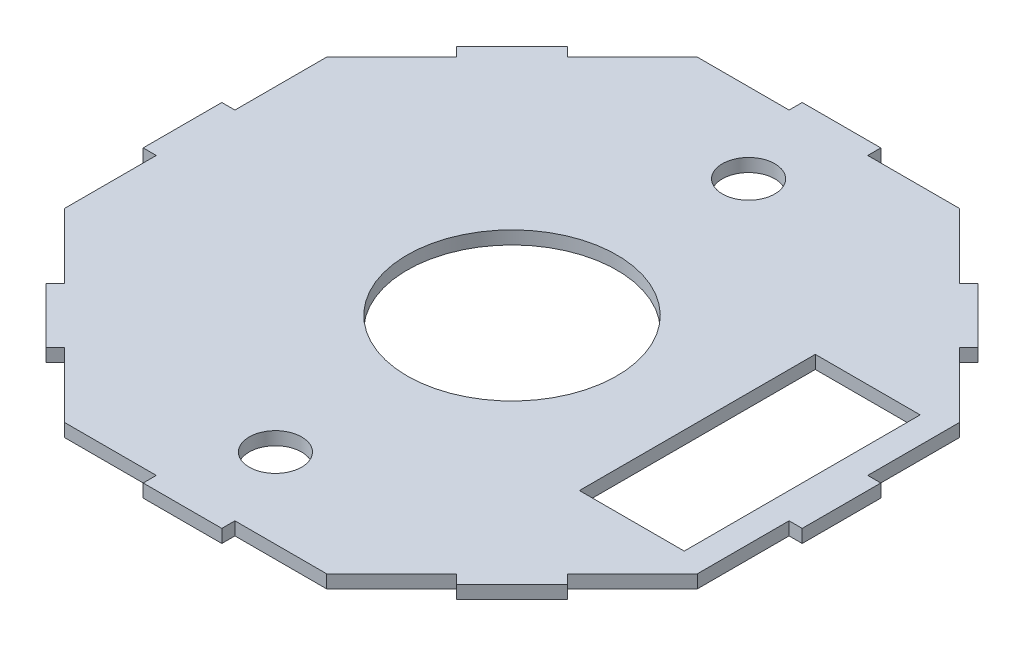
ISO-10303-21;
HEADER;
FILE_DESCRIPTION(('STEP AP214'),'2;1');
FILE_NAME('part.step','',(''),(''),'','','');
FILE_SCHEMA(('AUTOMOTIVE_DESIGN { 1 0 10303 214 1 1 1 1 }'));
ENDSEC;
DATA;
#1=APPLICATION_CONTEXT('core data for automotive mechanical design processes');
#2=APPLICATION_PROTOCOL_DEFINITION('international standard','automotive_design',2000,#1);
#3=PRODUCT_CONTEXT('',#1,'mechanical');
#4=PRODUCT('Part','Part','',(#3));
#5=PRODUCT_RELATED_PRODUCT_CATEGORY('part','',(#4));
#6=PRODUCT_DEFINITION_FORMATION('','',#4);
#7=PRODUCT_DEFINITION_CONTEXT('part definition',#1,'design');
#8=PRODUCT_DEFINITION('design','',#6,#7);
#9=PRODUCT_DEFINITION_SHAPE('','',#8);
#10=(LENGTH_UNIT() NAMED_UNIT(*) SI_UNIT(.MILLI.,.METRE.));
#11=(NAMED_UNIT(*) PLANE_ANGLE_UNIT() SI_UNIT($,.RADIAN.));
#12=(NAMED_UNIT(*) SI_UNIT($,.STERADIAN.) SOLID_ANGLE_UNIT());
#13=UNCERTAINTY_MEASURE_WITH_UNIT(LENGTH_MEASURE(1.E-05),#10,'distance_accuracy_value','');
#14=(GEOMETRIC_REPRESENTATION_CONTEXT(3) GLOBAL_UNCERTAINTY_ASSIGNED_CONTEXT((#13)) GLOBAL_UNIT_ASSIGNED_CONTEXT((#10,
#11,#12)) REPRESENTATION_CONTEXT('',''));
#15=CARTESIAN_POINT('',(0.,0.,0.));
#16=DIRECTION('',(0.,0.,1.));
#17=DIRECTION('',(1.,0.,0.));
#18=AXIS2_PLACEMENT_3D('',#15,#16,#17);
#19=CARTESIAN_POINT('',(104.801696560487,5.,8.72649424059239E-13));
#20=DIRECTION('',(1.,0.,0.));
#21=DIRECTION('',(0.,0.,-1.));
#22=AXIS2_PLACEMENT_3D('',#19,#20,#21);
#23=PLANE('',#22);
#24=DIRECTION('',(0.,0.,1.));
#25=VECTOR('',#24,1.);
#26=CARTESIAN_POINT('',(104.801696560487,0.,8.72649424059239E-13));
#27=LINE('',#26,#25);
#28=CARTESIAN_POINT('',(104.801696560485,0.,156.372402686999));
#29=VERTEX_POINT('',#28);
#30=CARTESIAN_POINT('',(104.801696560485,0.,161.372402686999));
#31=VERTEX_POINT('',#30);
#32=EDGE_CURVE('E346',#29,#31,#27,.T.);
#33=ORIENTED_EDGE('',*,*,#32,.F.);
#34=DIRECTION('',(0.,-1.,0.));
#35=VECTOR('',#34,1.);
#36=CARTESIAN_POINT('',(104.801696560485,5.,156.372402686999));
#37=LINE('',#36,#35);
#38=CARTESIAN_POINT('',(104.801696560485,5.,156.372402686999));
#39=VERTEX_POINT('',#38);
#40=EDGE_CURVE('E11',#39,#29,#37,.T.);
#41=ORIENTED_EDGE('',*,*,#40,.F.);
#42=DIRECTION('',(0.,0.,1.));
#43=VECTOR('',#42,1.);
#44=CARTESIAN_POINT('',(104.801696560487,5.,8.72649424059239E-13));
#45=LINE('',#44,#43);
#46=CARTESIAN_POINT('',(104.801696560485,5.,161.372402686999));
#47=VERTEX_POINT('',#46);
#48=EDGE_CURVE('E350',#39,#47,#45,.T.);
#49=ORIENTED_EDGE('',*,*,#48,.T.);
#50=DIRECTION('',(0.,-1.,0.));
#51=VECTOR('',#50,1.);
#52=CARTESIAN_POINT('',(104.801696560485,5.,161.372402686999));
#53=LINE('',#52,#51);
#54=EDGE_CURVE('E472',#47,#31,#53,.T.);
#55=ORIENTED_EDGE('',*,*,#54,.T.);
#56=EDGE_LOOP('',(#33,#41,#49,#55));
#57=FACE_BOUND('',#56,.T.);
#58=ADVANCED_FACE('F34',(#57),#23,.T.);
#59=CARTESIAN_POINT('',(7.44035322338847E-13,5.,156.372402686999));
#60=DIRECTION('',(0.,0.,1.));
#61=DIRECTION('',(1.,0.,0.));
#62=AXIS2_PLACEMENT_3D('',#59,#60,#61);
#63=PLANE('',#62);
#64=DIRECTION('',(-1.,0.,0.));
#65=VECTOR('',#64,1.);
#66=CARTESIAN_POINT('',(7.44035322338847E-13,0.,156.372402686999));
#67=LINE('',#66,#65);
#68=CARTESIAN_POINT('',(139.801696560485,0.,156.372402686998));
#69=VERTEX_POINT('',#68);
#70=EDGE_CURVE('E475',#69,#29,#67,.T.);
#71=ORIENTED_EDGE('',*,*,#70,.F.);
#72=DIRECTION('',(0.,-1.,0.));
#73=VECTOR('',#72,1.);
#74=CARTESIAN_POINT('',(139.801696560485,5.,156.372402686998));
#75=LINE('',#74,#73);
#76=CARTESIAN_POINT('',(139.801696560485,5.,156.372402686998));
#77=VERTEX_POINT('',#76);
#78=EDGE_CURVE('E41',#77,#69,#75,.T.);
#79=ORIENTED_EDGE('',*,*,#78,.F.);
#80=DIRECTION('',(-1.,0.,0.));
#81=VECTOR('',#80,1.);
#82=CARTESIAN_POINT('',(7.44035322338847E-13,5.,156.372402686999));
#83=LINE('',#82,#81);
#84=EDGE_CURVE('E353',#77,#39,#83,.T.);
#85=ORIENTED_EDGE('',*,*,#84,.T.);
#86=ORIENTED_EDGE('',*,*,#40,.T.);
#87=EDGE_LOOP('',(#71,#79,#85,#86));
#88=FACE_BOUND('',#87,.T.);
#89=ADVANCED_FACE('F681',(#88),#63,.T.);
#90=CARTESIAN_POINT('',(148.087049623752,5.,148.087049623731));
#91=DIRECTION('',(0.707106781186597,0.,0.707106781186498));
#92=DIRECTION('',(0.707106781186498,0.,-0.707106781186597));
#93=AXIS2_PLACEMENT_3D('',#90,#91,#92);
#94=PLANE('',#93);
#95=DIRECTION('',(-0.707106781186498,0.,0.707106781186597));
#96=VECTOR('',#95,1.);
#97=CARTESIAN_POINT('',(148.087049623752,0.,148.087049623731));
#98=LINE('',#97,#96);
#99=CARTESIAN_POINT('',(164.550433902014,0.,131.623665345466));
#100=VERTEX_POINT('',#99);
#101=EDGE_CURVE('E478',#100,#69,#98,.T.);
#102=ORIENTED_EDGE('',*,*,#101,.F.);
#103=DIRECTION('',(0.,-1.,0.));
#104=VECTOR('',#103,1.);
#105=CARTESIAN_POINT('',(164.550433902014,5.,131.623665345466));
#106=LINE('',#105,#104);
#107=CARTESIAN_POINT('',(164.550433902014,5.,131.623665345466));
#108=VERTEX_POINT('',#107);
#109=EDGE_CURVE('E673',#108,#100,#106,.T.);
#110=ORIENTED_EDGE('',*,*,#109,.F.);
#111=DIRECTION('',(-0.707106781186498,0.,0.707106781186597));
#112=VECTOR('',#111,1.);
#113=CARTESIAN_POINT('',(148.087049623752,5.,148.087049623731));
#114=LINE('',#113,#112);
#115=EDGE_CURVE('E357',#108,#77,#114,.T.);
#116=ORIENTED_EDGE('',*,*,#115,.T.);
#117=ORIENTED_EDGE('',*,*,#78,.T.);
#118=EDGE_LOOP('',(#102,#110,#116,#117));
#119=FACE_BOUND('',#118,.T.);
#120=ADVANCED_FACE('F677',(#119),#94,.T.);
#121=CARTESIAN_POINT('',(16.46338427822,5.,-16.4633842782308));
#122=DIRECTION('',(0.707106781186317,0.,-0.707106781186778));
#123=DIRECTION('',(-0.707106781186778,0.,-0.707106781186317));
#124=AXIS2_PLACEMENT_3D('',#121,#122,#123);
#125=PLANE('',#124);
#126=DIRECTION('',(0.707106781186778,0.,0.707106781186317));
#127=VECTOR('',#126,1.);
#128=CARTESIAN_POINT('',(16.46338427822,0.,-16.4633842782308));
#129=LINE('',#128,#127);
#130=CARTESIAN_POINT('',(168.085967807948,0.,135.159199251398));
#131=VERTEX_POINT('',#130);
#132=EDGE_CURVE('E481',#100,#131,#129,.T.);
#133=ORIENTED_EDGE('',*,*,#132,.T.);
#134=DIRECTION('',(0.,-1.,0.));
#135=VECTOR('',#134,1.);
#136=CARTESIAN_POINT('',(168.085967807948,5.,135.159199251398));
#137=LINE('',#136,#135);
#138=CARTESIAN_POINT('',(168.085967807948,5.,135.159199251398));
#139=VERTEX_POINT('',#138);
#140=EDGE_CURVE('E671',#139,#131,#137,.T.);
#141=ORIENTED_EDGE('',*,*,#140,.F.);
#142=DIRECTION('',(0.707106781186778,0.,0.707106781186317));
#143=VECTOR('',#142,1.);
#144=CARTESIAN_POINT('',(16.46338427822,5.,-16.4633842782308));
#145=LINE('',#144,#143);
#146=EDGE_CURVE('E360',#108,#139,#145,.T.);
#147=ORIENTED_EDGE('',*,*,#146,.F.);
#148=ORIENTED_EDGE('',*,*,#109,.T.);
#149=EDGE_LOOP('',(#133,#141,#147,#148));
#150=FACE_BOUND('',#149,.T.);
#151=ADVANCED_FACE('F691',(#150),#125,.F.);
#152=CARTESIAN_POINT('',(151.622583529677,5.,151.622583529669));
#153=DIRECTION('',(0.707106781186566,0.,0.707106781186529));
#154=DIRECTION('',(0.707106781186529,0.,-0.707106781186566));
#155=AXIS2_PLACEMENT_3D('',#152,#153,#154);
#156=PLANE('',#155);
#157=DIRECTION('',(-0.707106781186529,0.,0.707106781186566));
#158=VECTOR('',#157,1.);
#159=CARTESIAN_POINT('',(151.622583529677,0.,151.622583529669));
#160=LINE('',#159,#158);
#161=CARTESIAN_POINT('',(189.299171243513,0.,113.945995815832));
#162=VERTEX_POINT('',#161);
#163=EDGE_CURVE('E484',#162,#131,#160,.T.);
#164=ORIENTED_EDGE('',*,*,#163,.F.);
#165=DIRECTION('',(0.,-1.,0.));
#166=VECTOR('',#165,1.);
#167=CARTESIAN_POINT('',(189.299171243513,5.,113.945995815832));
#168=LINE('',#167,#166);
#169=CARTESIAN_POINT('',(189.299171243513,5.,113.945995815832));
#170=VERTEX_POINT('',#169);
#171=EDGE_CURVE('E669',#170,#162,#168,.T.);
#172=ORIENTED_EDGE('',*,*,#171,.F.);
#173=DIRECTION('',(-0.707106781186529,0.,0.707106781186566));
#174=VECTOR('',#173,1.);
#175=CARTESIAN_POINT('',(151.622583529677,5.,151.622583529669));
#176=LINE('',#175,#174);
#177=EDGE_CURVE('E362',#170,#139,#176,.T.);
#178=ORIENTED_EDGE('',*,*,#177,.T.);
#179=ORIENTED_EDGE('',*,*,#140,.T.);
#180=EDGE_LOOP('',(#164,#172,#178,#179));
#181=FACE_BOUND('',#180,.T.);
#182=ADVANCED_FACE('F843',(#181),#156,.T.);
#183=CARTESIAN_POINT('',(37.6765877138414,5.,-37.6765877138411));
#184=DIRECTION('',(-0.70710678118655,0.,0.707106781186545));
#185=DIRECTION('',(0.707106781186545,0.,0.70710678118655));
#186=AXIS2_PLACEMENT_3D('',#183,#184,#185);
#187=PLANE('',#186);
#188=DIRECTION('',(-0.707106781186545,0.,-0.70710678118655));
#189=VECTOR('',#188,1.);
#190=CARTESIAN_POINT('',(37.6765877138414,0.,-37.6765877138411));
#191=LINE('',#190,#189);
#192=CARTESIAN_POINT('',(185.76363733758,0.,110.410461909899));
#193=VERTEX_POINT('',#192);
#194=EDGE_CURVE('E487',#162,#193,#191,.T.);
#195=ORIENTED_EDGE('',*,*,#194,.T.);
#196=DIRECTION('',(0.,-1.,0.));
#197=VECTOR('',#196,1.);
#198=CARTESIAN_POINT('',(185.76363733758,5.,110.410461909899));
#199=LINE('',#198,#197);
#200=CARTESIAN_POINT('',(185.76363733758,5.,110.410461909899));
#201=VERTEX_POINT('',#200);
#202=EDGE_CURVE('E667',#201,#193,#199,.T.);
#203=ORIENTED_EDGE('',*,*,#202,.F.);
#204=DIRECTION('',(-0.707106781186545,0.,-0.70710678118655));
#205=VECTOR('',#204,1.);
#206=CARTESIAN_POINT('',(37.6765877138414,5.,-37.6765877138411));
#207=LINE('',#206,#205);
#208=EDGE_CURVE('E365',#170,#201,#207,.T.);
#209=ORIENTED_EDGE('',*,*,#208,.F.);
#210=ORIENTED_EDGE('',*,*,#171,.T.);
#211=EDGE_LOOP('',(#195,#203,#209,#210));
#212=FACE_BOUND('',#211,.T.);
#213=ADVANCED_FACE('F841',(#212),#187,.F.);
#214=CARTESIAN_POINT('',(148.087049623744,5.,148.087049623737));
#215=DIRECTION('',(0.707106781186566,0.,0.707106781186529));
#216=DIRECTION('',(0.707106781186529,0.,-0.707106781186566));
#217=AXIS2_PLACEMENT_3D('',#214,#215,#216);
#218=PLANE('',#217);
#219=DIRECTION('',(-0.707106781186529,0.,0.707106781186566));
#220=VECTOR('',#219,1.);
#221=CARTESIAN_POINT('',(148.087049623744,0.,148.087049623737));
#222=LINE('',#221,#220);
#223=CARTESIAN_POINT('',(210.512374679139,0.,85.6617245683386));
#224=VERTEX_POINT('',#223);
#225=EDGE_CURVE('E490',#224,#193,#222,.T.);
#226=ORIENTED_EDGE('',*,*,#225,.F.);
#227=DIRECTION('',(0.,-1.,0.));
#228=VECTOR('',#227,1.);
#229=CARTESIAN_POINT('',(210.512374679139,5.,85.6617245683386));
#230=LINE('',#229,#228);
#231=CARTESIAN_POINT('',(210.512374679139,5.,85.6617245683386));
#232=VERTEX_POINT('',#231);
#233=EDGE_CURVE('E665',#232,#224,#230,.T.);
#234=ORIENTED_EDGE('',*,*,#233,.F.);
#235=DIRECTION('',(-0.707106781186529,0.,0.707106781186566));
#236=VECTOR('',#235,1.);
#237=CARTESIAN_POINT('',(148.087049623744,5.,148.087049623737));
#238=LINE('',#237,#236);
#239=EDGE_CURVE('E367',#232,#201,#238,.T.);
#240=ORIENTED_EDGE('',*,*,#239,.T.);
#241=ORIENTED_EDGE('',*,*,#202,.T.);
#242=EDGE_LOOP('',(#226,#234,#240,#241));
#243=FACE_BOUND('',#242,.T.);
#244=ADVANCED_FACE('F836',(#243),#218,.T.);
#245=CARTESIAN_POINT('',(210.51237467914,5.,2.00327730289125E-12));
#246=DIRECTION('',(1.,0.,0.));
#247=DIRECTION('',(0.,0.,-1.));
#248=AXIS2_PLACEMENT_3D('',#245,#246,#247);
#249=PLANE('',#248);
#250=DIRECTION('',(0.,0.,1.));
#251=VECTOR('',#250,1.);
#252=CARTESIAN_POINT('',(210.51237467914,0.,2.00327730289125E-12));
#253=LINE('',#252,#251);
#254=CARTESIAN_POINT('',(210.512374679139,0.,50.6617245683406));
#255=VERTEX_POINT('',#254);
#256=EDGE_CURVE('E493',#255,#224,#253,.T.);
#257=ORIENTED_EDGE('',*,*,#256,.F.);
#258=DIRECTION('',(0.,-1.,0.));
#259=VECTOR('',#258,1.);
#260=CARTESIAN_POINT('',(210.512374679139,5.,50.6617245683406));
#261=LINE('',#260,#259);
#262=CARTESIAN_POINT('',(210.512374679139,5.,50.6617245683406));
#263=VERTEX_POINT('',#262);
#264=EDGE_CURVE('E663',#263,#255,#261,.T.);
#265=ORIENTED_EDGE('',*,*,#264,.F.);
#266=DIRECTION('',(0.,0.,1.));
#267=VECTOR('',#266,1.);
#268=CARTESIAN_POINT('',(210.51237467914,5.,2.00327730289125E-12));
#269=LINE('',#268,#267);
#270=EDGE_CURVE('E370',#263,#232,#269,.T.);
#271=ORIENTED_EDGE('',*,*,#270,.T.);
#272=ORIENTED_EDGE('',*,*,#233,.T.);
#273=EDGE_LOOP('',(#257,#265,#271,#272));
#274=FACE_BOUND('',#273,.T.);
#275=ADVANCED_FACE('F833',(#274),#249,.T.);
#276=CARTESIAN_POINT('',(1.01945536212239E-11,5.,50.661724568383));
#277=DIRECTION('',(-2.012279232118E-13,0.,-1.));
#278=DIRECTION('',(-1.,0.,2.012279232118E-13));
#279=AXIS2_PLACEMENT_3D('',#276,#277,#278);
#280=PLANE('',#279);
#281=DIRECTION('',(1.,0.,-2.012279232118E-13));
#282=VECTOR('',#281,1.);
#283=CARTESIAN_POINT('',(1.01945536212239E-11,0.,50.661724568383));
#284=LINE('',#283,#282);
#285=CARTESIAN_POINT('',(215.512374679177,0.,50.6617245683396));
#286=VERTEX_POINT('',#285);
#287=EDGE_CURVE('E496',#255,#286,#284,.T.);
#288=ORIENTED_EDGE('',*,*,#287,.T.);
#289=DIRECTION('',(0.,-1.,0.));
#290=VECTOR('',#289,1.);
#291=CARTESIAN_POINT('',(215.512374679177,5.,50.6617245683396));
#292=LINE('',#291,#290);
#293=CARTESIAN_POINT('',(215.512374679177,5.,50.6617245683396));
#294=VERTEX_POINT('',#293);
#295=EDGE_CURVE('E661',#294,#286,#292,.T.);
#296=ORIENTED_EDGE('',*,*,#295,.F.);
#297=DIRECTION('',(1.,0.,-2.012279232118E-13));
#298=VECTOR('',#297,1.);
#299=CARTESIAN_POINT('',(1.01945536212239E-11,5.,50.661724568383));
#300=LINE('',#299,#298);
#301=EDGE_CURVE('E373',#263,#294,#300,.T.);
#302=ORIENTED_EDGE('',*,*,#301,.F.);
#303=ORIENTED_EDGE('',*,*,#264,.T.);
#304=EDGE_LOOP('',(#288,#296,#302,#303));
#305=FACE_BOUND('',#304,.T.);
#306=ADVANCED_FACE('F830',(#305),#280,.F.);
#307=CARTESIAN_POINT('',(215.512374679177,5.,1.99389000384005E-12));
#308=DIRECTION('',(1.,0.,0.));
#309=DIRECTION('',(0.,0.,-1.));
#310=AXIS2_PLACEMENT_3D('',#307,#308,#309);
#311=PLANE('',#310);
#312=DIRECTION('',(0.,0.,1.));
#313=VECTOR('',#312,1.);
#314=CARTESIAN_POINT('',(215.512374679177,0.,1.99389000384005E-12));
#315=LINE('',#314,#313);
#316=CARTESIAN_POINT('',(215.512374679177,0.,20.6617245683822));
#317=VERTEX_POINT('',#316);
#318=EDGE_CURVE('E499',#317,#286,#315,.T.);
#319=ORIENTED_EDGE('',*,*,#318,.F.);
#320=DIRECTION('',(0.,-1.,0.));
#321=VECTOR('',#320,1.);
#322=CARTESIAN_POINT('',(215.512374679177,5.,20.6617245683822));
#323=LINE('',#322,#321);
#324=CARTESIAN_POINT('',(215.512374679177,5.,20.6617245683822));
#325=VERTEX_POINT('',#324);
#326=EDGE_CURVE('E659',#325,#317,#323,.T.);
#327=ORIENTED_EDGE('',*,*,#326,.F.);
#328=DIRECTION('',(0.,0.,1.));
#329=VECTOR('',#328,1.);
#330=CARTESIAN_POINT('',(215.512374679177,5.,1.99389000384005E-12));
#331=LINE('',#330,#329);
#332=EDGE_CURVE('E375',#325,#294,#331,.T.);
#333=ORIENTED_EDGE('',*,*,#332,.T.);
#334=ORIENTED_EDGE('',*,*,#295,.T.);
#335=EDGE_LOOP('',(#319,#327,#333,#334));
#336=FACE_BOUND('',#335,.T.);
#337=ADVANCED_FACE('F825',(#336),#311,.T.);
#338=CARTESIAN_POINT('',(4.18638982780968E-12,5.,20.6617245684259));
#339=DIRECTION('',(-2.02615701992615E-13,0.,-1.));
#340=DIRECTION('',(-1.,0.,2.02615701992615E-13));
#341=AXIS2_PLACEMENT_3D('',#338,#339,#340);
#342=PLANE('',#341);
#343=DIRECTION('',(1.,0.,-2.02615701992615E-13));
#344=VECTOR('',#343,1.);
#345=CARTESIAN_POINT('',(4.18638982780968E-12,0.,20.6617245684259));
#346=LINE('',#345,#344);
#347=CARTESIAN_POINT('',(210.512374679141,0.,20.6617245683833));
#348=VERTEX_POINT('',#347);
#349=EDGE_CURVE('E502',#348,#317,#346,.T.);
#350=ORIENTED_EDGE('',*,*,#349,.F.);
#351=DIRECTION('',(0.,-1.,0.));
#352=VECTOR('',#351,1.);
#353=CARTESIAN_POINT('',(210.512374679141,5.,20.6617245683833));
#354=LINE('',#353,#352);
#355=CARTESIAN_POINT('',(210.512374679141,5.,20.6617245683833));
#356=VERTEX_POINT('',#355);
#357=EDGE_CURVE('E657',#356,#348,#354,.T.);
#358=ORIENTED_EDGE('',*,*,#357,.F.);
#359=DIRECTION('',(1.,0.,-2.02615701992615E-13));
#360=VECTOR('',#359,1.);
#361=CARTESIAN_POINT('',(4.18638982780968E-12,5.,20.6617245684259));
#362=LINE('',#361,#360);
#363=EDGE_CURVE('E378',#356,#325,#362,.T.);
#364=ORIENTED_EDGE('',*,*,#363,.T.);
#365=ORIENTED_EDGE('',*,*,#326,.T.);
#366=EDGE_LOOP('',(#350,#358,#364,#365));
#367=FACE_BOUND('',#366,.T.);
#368=ADVANCED_FACE('F820',(#367),#342,.T.);
#369=CARTESIAN_POINT('',(210.512374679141,5.,2.17021707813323E-12));
#370=DIRECTION('',(1.,0.,0.));
#371=DIRECTION('',(0.,0.,-1.));
#372=AXIS2_PLACEMENT_3D('',#369,#370,#371);
#373=PLANE('',#372);
#374=DIRECTION('',(0.,0.,1.));
#375=VECTOR('',#374,1.);
#376=CARTESIAN_POINT('',(210.512374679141,0.,2.17021707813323E-12));
#377=LINE('',#376,#375);
#378=CARTESIAN_POINT('',(210.512374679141,0.,-14.3382754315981));
#379=VERTEX_POINT('',#378);
#380=EDGE_CURVE('E505',#379,#348,#377,.T.);
#381=ORIENTED_EDGE('',*,*,#380,.F.);
#382=DIRECTION('',(0.,-1.,0.));
#383=VECTOR('',#382,1.);
#384=CARTESIAN_POINT('',(210.512374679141,5.,-14.3382754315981));
#385=LINE('',#384,#383);
#386=CARTESIAN_POINT('',(210.512374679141,5.,-14.3382754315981));
#387=VERTEX_POINT('',#386);
#388=EDGE_CURVE('E655',#387,#379,#385,.T.);
#389=ORIENTED_EDGE('',*,*,#388,.F.);
#390=DIRECTION('',(0.,0.,1.));
#391=VECTOR('',#390,1.);
#392=CARTESIAN_POINT('',(210.512374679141,5.,2.17021707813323E-12));
#393=LINE('',#392,#391);
#394=EDGE_CURVE('E381',#387,#356,#393,.T.);
#395=ORIENTED_EDGE('',*,*,#394,.T.);
#396=ORIENTED_EDGE('',*,*,#357,.T.);
#397=EDGE_LOOP('',(#381,#389,#395,#396));
#398=FACE_BOUND('',#397,.T.);
#399=ADVANCED_FACE('F816',(#398),#373,.T.);
#400=CARTESIAN_POINT('',(112.425325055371,5.,-112.425325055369));
#401=DIRECTION('',(0.707106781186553,0.,-0.707106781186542));
#402=DIRECTION('',(-0.707106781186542,0.,-0.707106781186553));
#403=AXIS2_PLACEMENT_3D('',#400,#401,#402);
#404=PLANE('',#403);
#405=DIRECTION('',(0.707106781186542,0.,0.707106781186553));
#406=VECTOR('',#405,1.);
#407=CARTESIAN_POINT('',(112.425325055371,0.,-112.425325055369));
#408=LINE('',#407,#406);
#409=CARTESIAN_POINT('',(185.763637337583,0.,-39.0870127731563));
#410=VERTEX_POINT('',#409);
#411=EDGE_CURVE('E508',#410,#379,#408,.T.);
#412=ORIENTED_EDGE('',*,*,#411,.F.);
#413=DIRECTION('',(0.,-1.,0.));
#414=VECTOR('',#413,1.);
#415=CARTESIAN_POINT('',(185.763637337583,5.,-39.0870127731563));
#416=LINE('',#415,#414);
#417=CARTESIAN_POINT('',(185.763637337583,5.,-39.0870127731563));
#418=VERTEX_POINT('',#417);
#419=EDGE_CURVE('E653',#418,#410,#416,.T.);
#420=ORIENTED_EDGE('',*,*,#419,.F.);
#421=DIRECTION('',(0.707106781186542,0.,0.707106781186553));
#422=VECTOR('',#421,1.);
#423=CARTESIAN_POINT('',(112.425325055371,5.,-112.425325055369));
#424=LINE('',#423,#422);
#425=EDGE_CURVE('E384',#418,#387,#424,.T.);
#426=ORIENTED_EDGE('',*,*,#425,.T.);
#427=ORIENTED_EDGE('',*,*,#388,.T.);
#428=EDGE_LOOP('',(#412,#420,#426,#427));
#429=FACE_BOUND('',#428,.T.);
#430=ADVANCED_FACE('F812',(#429),#404,.T.);
#431=CARTESIAN_POINT('',(73.3383122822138,5.,73.3383122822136));
#432=DIRECTION('',(0.707106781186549,0.,0.707106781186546));
#433=DIRECTION('',(0.707106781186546,0.,-0.707106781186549));
#434=AXIS2_PLACEMENT_3D('',#431,#432,#433);
#435=PLANE('',#434);
#436=DIRECTION('',(-0.707106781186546,0.,0.707106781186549));
#437=VECTOR('',#436,1.);
#438=CARTESIAN_POINT('',(73.3383122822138,0.,73.3383122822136));
#439=LINE('',#438,#437);
#440=CARTESIAN_POINT('',(189.299171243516,0.,-42.622546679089));
#441=VERTEX_POINT('',#440);
#442=EDGE_CURVE('E511',#441,#410,#439,.T.);
#443=ORIENTED_EDGE('',*,*,#442,.F.);
#444=DIRECTION('',(0.,-1.,0.));
#445=VECTOR('',#444,1.);
#446=CARTESIAN_POINT('',(189.299171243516,5.,-42.622546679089));
#447=LINE('',#446,#445);
#448=CARTESIAN_POINT('',(189.299171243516,5.,-42.622546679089));
#449=VERTEX_POINT('',#448);
#450=EDGE_CURVE('E651',#449,#441,#447,.T.);
#451=ORIENTED_EDGE('',*,*,#450,.F.);
#452=DIRECTION('',(-0.707106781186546,0.,0.707106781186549));
#453=VECTOR('',#452,1.);
#454=CARTESIAN_POINT('',(73.3383122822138,5.,73.3383122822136));
#455=LINE('',#454,#453);
#456=EDGE_CURVE('E387',#449,#418,#455,.T.);
#457=ORIENTED_EDGE('',*,*,#456,.T.);
#458=ORIENTED_EDGE('',*,*,#419,.T.);
#459=EDGE_LOOP('',(#443,#451,#457,#458));
#460=FACE_BOUND('',#459,.T.);
#461=ADVANCED_FACE('F808',(#460),#435,.T.);
#462=CARTESIAN_POINT('',(115.960858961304,5.,-115.960858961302));
#463=DIRECTION('',(0.707106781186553,0.,-0.707106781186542));
#464=DIRECTION('',(-0.707106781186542,0.,-0.707106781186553));
#465=AXIS2_PLACEMENT_3D('',#462,#463,#464);
#466=PLANE('',#465);
#467=DIRECTION('',(0.707106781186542,0.,0.707106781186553));
#468=VECTOR('',#467,1.);
#469=CARTESIAN_POINT('',(115.960858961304,0.,-115.960858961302));
#470=LINE('',#469,#468);
#471=CARTESIAN_POINT('',(168.085967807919,0.,-63.8357501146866));
#472=VERTEX_POINT('',#471);
#473=EDGE_CURVE('E514',#472,#441,#470,.T.);
#474=ORIENTED_EDGE('',*,*,#473,.F.);
#475=DIRECTION('',(0.,-1.,0.));
#476=VECTOR('',#475,1.);
#477=CARTESIAN_POINT('',(168.085967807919,5.,-63.8357501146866));
#478=LINE('',#477,#476);
#479=CARTESIAN_POINT('',(168.085967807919,5.,-63.8357501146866));
#480=VERTEX_POINT('',#479);
#481=EDGE_CURVE('E649',#480,#472,#478,.T.);
#482=ORIENTED_EDGE('',*,*,#481,.F.);
#483=DIRECTION('',(0.707106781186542,0.,0.707106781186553));
#484=VECTOR('',#483,1.);
#485=CARTESIAN_POINT('',(115.960858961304,5.,-115.960858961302));
#486=LINE('',#485,#484);
#487=EDGE_CURVE('E390',#480,#449,#486,.T.);
#488=ORIENTED_EDGE('',*,*,#487,.T.);
#489=ORIENTED_EDGE('',*,*,#450,.T.);
#490=EDGE_LOOP('',(#474,#482,#488,#489));
#491=FACE_BOUND('',#490,.T.);
#492=ADVANCED_FACE('F803',(#491),#466,.T.);
#493=CARTESIAN_POINT('',(52.1251088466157,5.,52.1251088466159));
#494=DIRECTION('',(0.707106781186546,0.,0.707106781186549));
#495=DIRECTION('',(0.707106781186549,0.,-0.707106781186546));
#496=AXIS2_PLACEMENT_3D('',#493,#494,#495);
#497=PLANE('',#496);
#498=DIRECTION('',(-0.707106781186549,0.,0.707106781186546));
#499=VECTOR('',#498,1.);
#500=CARTESIAN_POINT('',(52.1251088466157,0.,52.1251088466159));
#501=LINE('',#500,#499);
#502=CARTESIAN_POINT('',(164.550433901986,0.,-60.3002162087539));
#503=VERTEX_POINT('',#502);
#504=EDGE_CURVE('E517',#472,#503,#501,.T.);
#505=ORIENTED_EDGE('',*,*,#504,.T.);
#506=DIRECTION('',(0.,-1.,0.));
#507=VECTOR('',#506,1.);
#508=CARTESIAN_POINT('',(164.550433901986,5.,-60.3002162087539));
#509=LINE('',#508,#507);
#510=CARTESIAN_POINT('',(164.550433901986,5.,-60.3002162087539));
#511=VERTEX_POINT('',#510);
#512=EDGE_CURVE('E647',#511,#503,#509,.T.);
#513=ORIENTED_EDGE('',*,*,#512,.F.);
#514=DIRECTION('',(-0.707106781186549,0.,0.707106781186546));
#515=VECTOR('',#514,1.);
#516=CARTESIAN_POINT('',(52.1251088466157,5.,52.1251088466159));
#517=LINE('',#516,#515);
#518=EDGE_CURVE('E393',#480,#511,#517,.T.);
#519=ORIENTED_EDGE('',*,*,#518,.F.);
#520=ORIENTED_EDGE('',*,*,#481,.T.);
#521=EDGE_LOOP('',(#505,#513,#519,#520));
#522=FACE_BOUND('',#521,.T.);
#523=ADVANCED_FACE('F800',(#522),#497,.F.);
#524=CARTESIAN_POINT('',(112.425325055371,5.,-112.425325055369));
#525=DIRECTION('',(0.707106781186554,0.,-0.707106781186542));
#526=DIRECTION('',(-0.707106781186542,0.,-0.707106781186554));
#527=AXIS2_PLACEMENT_3D('',#524,#525,#526);
#528=PLANE('',#527);
#529=DIRECTION('',(0.707106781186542,0.,0.707106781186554));
#530=VECTOR('',#529,1.);
#531=CARTESIAN_POINT('',(112.425325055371,0.,-112.425325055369));
#532=LINE('',#531,#530);
#533=CARTESIAN_POINT('',(139.801696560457,0.,-85.0489535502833));
#534=VERTEX_POINT('',#533);
#535=EDGE_CURVE('E520',#534,#503,#532,.T.);
#536=ORIENTED_EDGE('',*,*,#535,.F.);
#537=DIRECTION('',(0.,-1.,0.));
#538=VECTOR('',#537,1.);
#539=CARTESIAN_POINT('',(139.801696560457,5.,-85.0489535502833));
#540=LINE('',#539,#538);
#541=CARTESIAN_POINT('',(139.801696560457,5.,-85.0489535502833));
#542=VERTEX_POINT('',#541);
#543=EDGE_CURVE('E645',#542,#534,#540,.T.);
#544=ORIENTED_EDGE('',*,*,#543,.F.);
#545=DIRECTION('',(0.707106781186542,0.,0.707106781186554));
#546=VECTOR('',#545,1.);
#547=CARTESIAN_POINT('',(112.425325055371,5.,-112.425325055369));
#548=LINE('',#547,#546);
#549=EDGE_CURVE('E395',#542,#511,#548,.T.);
#550=ORIENTED_EDGE('',*,*,#549,.T.);
#551=ORIENTED_EDGE('',*,*,#512,.T.);
#552=EDGE_LOOP('',(#536,#544,#550,#551));
#553=FACE_BOUND('',#552,.T.);
#554=ADVANCED_FACE('F796',(#553),#528,.T.);
#555=CARTESIAN_POINT('',(4.38393922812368E-13,5.,-85.048953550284));
#556=DIRECTION('',(0.,0.,-1.));
#557=DIRECTION('',(-1.,0.,0.));
#558=AXIS2_PLACEMENT_3D('',#555,#556,#557);
#559=PLANE('',#558);
#560=DIRECTION('',(1.,0.,0.));
#561=VECTOR('',#560,1.);
#562=CARTESIAN_POINT('',(4.38393922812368E-13,0.,-85.048953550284));
#563=LINE('',#562,#561);
#564=CARTESIAN_POINT('',(104.801696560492,0.,-85.0489535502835));
#565=VERTEX_POINT('',#564);
#566=EDGE_CURVE('E523',#565,#534,#563,.T.);
#567=ORIENTED_EDGE('',*,*,#566,.F.);
#568=DIRECTION('',(0.,-1.,0.));
#569=VECTOR('',#568,1.);
#570=CARTESIAN_POINT('',(104.801696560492,5.,-85.0489535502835));
#571=LINE('',#570,#569);
#572=CARTESIAN_POINT('',(104.801696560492,5.,-85.0489535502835));
#573=VERTEX_POINT('',#572);
#574=EDGE_CURVE('E643',#573,#565,#571,.T.);
#575=ORIENTED_EDGE('',*,*,#574,.F.);
#576=DIRECTION('',(1.,0.,0.));
#577=VECTOR('',#576,1.);
#578=CARTESIAN_POINT('',(4.38393922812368E-13,5.,-85.048953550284));
#579=LINE('',#578,#577);
#580=EDGE_CURVE('E398',#573,#542,#579,.T.);
#581=ORIENTED_EDGE('',*,*,#580,.T.);
#582=ORIENTED_EDGE('',*,*,#543,.T.);
#583=EDGE_LOOP('',(#567,#575,#581,#582));
#584=FACE_BOUND('',#583,.T.);
#585=ADVANCED_FACE('F792',(#584),#559,.T.);
#586=CARTESIAN_POINT('',(104.801696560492,5.,0.));
#587=DIRECTION('',(1.,0.,0.));
#588=DIRECTION('',(0.,0.,-1.));
#589=AXIS2_PLACEMENT_3D('',#586,#587,#588);
#590=PLANE('',#589);
#591=DIRECTION('',(0.,0.,1.));
#592=VECTOR('',#591,1.);
#593=CARTESIAN_POINT('',(104.801696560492,0.,0.));
#594=LINE('',#593,#592);
#595=CARTESIAN_POINT('',(104.801696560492,0.,-90.0489535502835));
#596=VERTEX_POINT('',#595);
#597=EDGE_CURVE('E526',#596,#565,#594,.T.);
#598=ORIENTED_EDGE('',*,*,#597,.F.);
#599=DIRECTION('',(0.,-1.,0.));
#600=VECTOR('',#599,1.);
#601=CARTESIAN_POINT('',(104.801696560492,5.,-90.0489535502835));
#602=LINE('',#601,#600);
#603=CARTESIAN_POINT('',(104.801696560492,5.,-90.0489535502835));
#604=VERTEX_POINT('',#603);
#605=EDGE_CURVE('E641',#604,#596,#602,.T.);
#606=ORIENTED_EDGE('',*,*,#605,.F.);
#607=DIRECTION('',(0.,0.,1.));
#608=VECTOR('',#607,1.);
#609=CARTESIAN_POINT('',(104.801696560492,5.,0.));
#610=LINE('',#609,#608);
#611=EDGE_CURVE('E401',#604,#573,#610,.T.);
#612=ORIENTED_EDGE('',*,*,#611,.T.);
#613=ORIENTED_EDGE('',*,*,#574,.T.);
#614=EDGE_LOOP('',(#598,#606,#612,#613));
#615=FACE_BOUND('',#614,.T.);
#616=ADVANCED_FACE('F787',(#615),#590,.T.);
#617=CARTESIAN_POINT('',(4.58216098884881E-13,5.,-90.048953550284));
#618=DIRECTION('',(0.,0.,-1.));
#619=DIRECTION('',(-1.,0.,0.));
#620=AXIS2_PLACEMENT_3D('',#617,#618,#619);
#621=PLANE('',#620);
#622=DIRECTION('',(1.,0.,0.));
#623=VECTOR('',#622,1.);
#624=CARTESIAN_POINT('',(4.58216098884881E-13,0.,-90.048953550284));
#625=LINE('',#624,#623);
#626=CARTESIAN_POINT('',(74.8016965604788,0.,-90.0489535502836));
#627=VERTEX_POINT('',#626);
#628=EDGE_CURVE('E529',#627,#596,#625,.T.);
#629=ORIENTED_EDGE('',*,*,#628,.F.);
#630=DIRECTION('',(0.,-1.,0.));
#631=VECTOR('',#630,1.);
#632=CARTESIAN_POINT('',(74.8016965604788,5.,-90.0489535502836));
#633=LINE('',#632,#631);
#634=CARTESIAN_POINT('',(74.8016965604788,5.,-90.0489535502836));
#635=VERTEX_POINT('',#634);
#636=EDGE_CURVE('E639',#635,#627,#633,.T.);
#637=ORIENTED_EDGE('',*,*,#636,.F.);
#638=DIRECTION('',(1.,0.,0.));
#639=VECTOR('',#638,1.);
#640=CARTESIAN_POINT('',(4.58216098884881E-13,5.,-90.048953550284));
#641=LINE('',#640,#639);
#642=EDGE_CURVE('E404',#635,#604,#641,.T.);
#643=ORIENTED_EDGE('',*,*,#642,.T.);
#644=ORIENTED_EDGE('',*,*,#605,.T.);
#645=EDGE_LOOP('',(#629,#637,#643,#644));
#646=FACE_BOUND('',#645,.T.);
#647=ADVANCED_FACE('F783',(#646),#621,.T.);
#648=CARTESIAN_POINT('',(74.801696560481,5.,-1.86854773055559E-12));
#649=DIRECTION('',(-1.,0.,0.));
#650=DIRECTION('',(0.,0.,1.));
#651=AXIS2_PLACEMENT_3D('',#648,#649,#650);
#652=PLANE('',#651);
#653=DIRECTION('',(0.,0.,-1.));
#654=VECTOR('',#653,1.);
#655=CARTESIAN_POINT('',(74.801696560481,0.,-1.86854773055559E-12));
#656=LINE('',#655,#654);
#657=CARTESIAN_POINT('',(74.8016965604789,0.,-85.0489535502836));
#658=VERTEX_POINT('',#657);
#659=EDGE_CURVE('E532',#658,#627,#656,.T.);
#660=ORIENTED_EDGE('',*,*,#659,.F.);
#661=DIRECTION('',(0.,-1.,0.));
#662=VECTOR('',#661,1.);
#663=CARTESIAN_POINT('',(74.8016965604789,5.,-85.0489535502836));
#664=LINE('',#663,#662);
#665=CARTESIAN_POINT('',(74.8016965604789,5.,-85.0489535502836));
#666=VERTEX_POINT('',#665);
#667=EDGE_CURVE('E637',#666,#658,#664,.T.);
#668=ORIENTED_EDGE('',*,*,#667,.F.);
#669=DIRECTION('',(0.,0.,-1.));
#670=VECTOR('',#669,1.);
#671=CARTESIAN_POINT('',(74.801696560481,5.,-1.86854773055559E-12));
#672=LINE('',#671,#670);
#673=EDGE_CURVE('E407',#666,#635,#672,.T.);
#674=ORIENTED_EDGE('',*,*,#673,.T.);
#675=ORIENTED_EDGE('',*,*,#636,.T.);
#676=EDGE_LOOP('',(#660,#668,#674,#675));
#677=FACE_BOUND('',#676,.T.);
#678=ADVANCED_FACE('F779',(#677),#652,.T.);
#679=CARTESIAN_POINT('',(4.38393922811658E-13,5.,-85.048953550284));
#680=DIRECTION('',(0.,0.,-1.));
#681=DIRECTION('',(-1.,0.,0.));
#682=AXIS2_PLACEMENT_3D('',#679,#680,#681);
#683=PLANE('',#682);
#684=DIRECTION('',(1.,0.,0.));
#685=VECTOR('',#684,1.);
#686=CARTESIAN_POINT('',(4.38393922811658E-13,0.,-85.048953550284));
#687=LINE('',#686,#685);
#688=CARTESIAN_POINT('',(39.801696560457,0.,-85.0489535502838));
#689=VERTEX_POINT('',#688);
#690=EDGE_CURVE('E535',#689,#658,#687,.T.);
#691=ORIENTED_EDGE('',*,*,#690,.F.);
#692=DIRECTION('',(0.,-1.,0.));
#693=VECTOR('',#692,1.);
#694=CARTESIAN_POINT('',(39.801696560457,5.,-85.0489535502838));
#695=LINE('',#694,#693);
#696=CARTESIAN_POINT('',(39.801696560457,5.,-85.0489535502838));
#697=VERTEX_POINT('',#696);
#698=EDGE_CURVE('E635',#697,#689,#695,.T.);
#699=ORIENTED_EDGE('',*,*,#698,.F.);
#700=DIRECTION('',(1.,0.,0.));
#701=VECTOR('',#700,1.);
#702=CARTESIAN_POINT('',(4.38393922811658E-13,5.,-85.048953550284));
#703=LINE('',#702,#701);
#704=EDGE_CURVE('E410',#697,#666,#703,.T.);
#705=ORIENTED_EDGE('',*,*,#704,.T.);
#706=ORIENTED_EDGE('',*,*,#667,.T.);
#707=EDGE_LOOP('',(#691,#699,#705,#706));
#708=FACE_BOUND('',#707,.T.);
#709=ADVANCED_FACE('F775',(#708),#683,.T.);
#710=CARTESIAN_POINT('',(-22.6236284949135,5.,-22.6236284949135));
#711=DIRECTION('',(-0.707106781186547,0.,-0.707106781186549));
#712=DIRECTION('',(-0.707106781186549,0.,0.707106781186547));
#713=AXIS2_PLACEMENT_3D('',#710,#711,#712);
#714=PLANE('',#713);
#715=DIRECTION('',(0.707106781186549,0.,-0.707106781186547));
#716=VECTOR('',#715,1.);
#717=CARTESIAN_POINT('',(-22.6236284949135,0.,-22.6236284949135));
#718=LINE('',#717,#716);
#719=CARTESIAN_POINT('',(15.0529592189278,0.,-60.3002162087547));
#720=VERTEX_POINT('',#719);
#721=EDGE_CURVE('E538',#720,#689,#718,.T.);
#722=ORIENTED_EDGE('',*,*,#721,.F.);
#723=DIRECTION('',(0.,-1.,0.));
#724=VECTOR('',#723,1.);
#725=CARTESIAN_POINT('',(15.0529592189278,5.,-60.3002162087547));
#726=LINE('',#725,#724);
#727=CARTESIAN_POINT('',(15.0529592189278,5.,-60.3002162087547));
#728=VERTEX_POINT('',#727);
#729=EDGE_CURVE('E633',#728,#720,#726,.T.);
#730=ORIENTED_EDGE('',*,*,#729,.F.);
#731=DIRECTION('',(0.707106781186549,0.,-0.707106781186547));
#732=VECTOR('',#731,1.);
#733=CARTESIAN_POINT('',(-22.6236284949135,5.,-22.6236284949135));
#734=LINE('',#733,#732);
#735=EDGE_CURVE('E413',#728,#697,#734,.T.);
#736=ORIENTED_EDGE('',*,*,#735,.T.);
#737=ORIENTED_EDGE('',*,*,#698,.T.);
#738=EDGE_LOOP('',(#722,#730,#736,#737));
#739=FACE_BOUND('',#738,.T.);
#740=ADVANCED_FACE('F770',(#739),#714,.T.);
#741=CARTESIAN_POINT('',(37.6765877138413,5.,-37.676587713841));
#742=DIRECTION('',(-0.70710678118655,0.,0.707106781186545));
#743=DIRECTION('',(0.707106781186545,0.,0.70710678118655));
#744=AXIS2_PLACEMENT_3D('',#741,#742,#743);
#745=PLANE('',#744);
#746=DIRECTION('',(-0.707106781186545,0.,-0.70710678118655));
#747=VECTOR('',#746,1.);
#748=CARTESIAN_POINT('',(37.6765877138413,0.,-37.676587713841));
#749=LINE('',#748,#747);
#750=CARTESIAN_POINT('',(11.5174253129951,0.,-63.8357501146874));
#751=VERTEX_POINT('',#750);
#752=EDGE_CURVE('E541',#720,#751,#749,.T.);
#753=ORIENTED_EDGE('',*,*,#752,.T.);
#754=DIRECTION('',(0.,-1.,0.));
#755=VECTOR('',#754,1.);
#756=CARTESIAN_POINT('',(11.5174253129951,5.,-63.8357501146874));
#757=LINE('',#756,#755);
#758=CARTESIAN_POINT('',(11.5174253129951,5.,-63.8357501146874));
#759=VERTEX_POINT('',#758);
#760=EDGE_CURVE('E631',#759,#751,#757,.T.);
#761=ORIENTED_EDGE('',*,*,#760,.F.);
#762=DIRECTION('',(-0.707106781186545,0.,-0.70710678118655));
#763=VECTOR('',#762,1.);
#764=CARTESIAN_POINT('',(37.6765877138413,5.,-37.676587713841));
#765=LINE('',#764,#763);
#766=EDGE_CURVE('E416',#728,#759,#765,.T.);
#767=ORIENTED_EDGE('',*,*,#766,.F.);
#768=ORIENTED_EDGE('',*,*,#729,.T.);
#769=EDGE_LOOP('',(#753,#761,#767,#768));
#770=FACE_BOUND('',#769,.T.);
#771=ADVANCED_FACE('F767',(#770),#745,.F.);
#772=CARTESIAN_POINT('',(-26.1591624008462,5.,-26.1591624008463));
#773=DIRECTION('',(-0.707106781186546,0.,-0.707106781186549));
#774=DIRECTION('',(-0.707106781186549,0.,0.707106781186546));
#775=AXIS2_PLACEMENT_3D('',#772,#773,#774);
#776=PLANE('',#775);
#777=DIRECTION('',(0.707106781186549,0.,-0.707106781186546));
#778=VECTOR('',#777,1.);
#779=CARTESIAN_POINT('',(-26.1591624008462,0.,-26.1591624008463));
#780=LINE('',#779,#778);
#781=CARTESIAN_POINT('',(-9.69577812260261,0.,-42.6225466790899));
#782=VERTEX_POINT('',#781);
#783=EDGE_CURVE('E544',#782,#751,#780,.T.);
#784=ORIENTED_EDGE('',*,*,#783,.F.);
#785=DIRECTION('',(0.,-1.,0.));
#786=VECTOR('',#785,1.);
#787=CARTESIAN_POINT('',(-9.69577812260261,5.,-42.6225466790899));
#788=LINE('',#787,#786);
#789=CARTESIAN_POINT('',(-9.69577812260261,5.,-42.6225466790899));
#790=VERTEX_POINT('',#789);
#791=EDGE_CURVE('E629',#790,#782,#788,.T.);
#792=ORIENTED_EDGE('',*,*,#791,.F.);
#793=DIRECTION('',(0.707106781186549,0.,-0.707106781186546));
#794=VECTOR('',#793,1.);
#795=CARTESIAN_POINT('',(-26.1591624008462,5.,-26.1591624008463));
#796=LINE('',#795,#794);
#797=EDGE_CURVE('E418',#790,#759,#796,.T.);
#798=ORIENTED_EDGE('',*,*,#797,.T.);
#799=ORIENTED_EDGE('',*,*,#760,.T.);
#800=EDGE_LOOP('',(#784,#792,#798,#799));
#801=FACE_BOUND('',#800,.T.);
#802=ADVANCED_FACE('F761',(#801),#776,.T.);
#803=CARTESIAN_POINT('',(16.4633842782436,5.,-16.4633842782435));
#804=DIRECTION('',(0.70710678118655,0.,-0.707106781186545));
#805=DIRECTION('',(-0.707106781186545,0.,-0.70710678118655));
#806=AXIS2_PLACEMENT_3D('',#803,#804,#805);
#807=PLANE('',#806);
#808=DIRECTION('',(0.707106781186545,0.,0.70710678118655));
#809=VECTOR('',#808,1.);
#810=CARTESIAN_POINT('',(16.4633842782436,0.,-16.4633842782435));
#811=LINE('',#810,#809);
#812=CARTESIAN_POINT('',(-6.16024421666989,0.,-39.0870127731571));
#813=VERTEX_POINT('',#812);
#814=EDGE_CURVE('E547',#782,#813,#811,.T.);
#815=ORIENTED_EDGE('',*,*,#814,.T.);
#816=DIRECTION('',(0.,-1.,0.));
#817=VECTOR('',#816,1.);
#818=CARTESIAN_POINT('',(-6.16024421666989,5.,-39.0870127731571));
#819=LINE('',#818,#817);
#820=CARTESIAN_POINT('',(-6.16024421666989,5.,-39.0870127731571));
#821=VERTEX_POINT('',#820);
#822=EDGE_CURVE('E627',#821,#813,#819,.T.);
#823=ORIENTED_EDGE('',*,*,#822,.F.);
#824=DIRECTION('',(0.707106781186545,0.,0.70710678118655));
#825=VECTOR('',#824,1.);
#826=CARTESIAN_POINT('',(16.4633842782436,5.,-16.4633842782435));
#827=LINE('',#826,#825);
#828=EDGE_CURVE('E421',#790,#821,#827,.T.);
#829=ORIENTED_EDGE('',*,*,#828,.F.);
#830=ORIENTED_EDGE('',*,*,#791,.T.);
#831=EDGE_LOOP('',(#815,#823,#829,#830));
#832=FACE_BOUND('',#831,.T.);
#833=ADVANCED_FACE('F844',(#832),#807,.F.);
#834=CARTESIAN_POINT('',(-22.6236284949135,5.,-22.6236284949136));
#835=DIRECTION('',(-0.707106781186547,0.,-0.707106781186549));
#836=DIRECTION('',(-0.707106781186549,0.,0.707106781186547));
#837=AXIS2_PLACEMENT_3D('',#834,#835,#836);
#838=PLANE('',#837);
#839=DIRECTION('',(0.707106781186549,0.,-0.707106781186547));
#840=VECTOR('',#839,1.);
#841=CARTESIAN_POINT('',(-22.6236284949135,0.,-22.6236284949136));
#842=LINE('',#841,#840);
#843=CARTESIAN_POINT('',(-30.908981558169,0.,-14.3382754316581));
#844=VERTEX_POINT('',#843);
#845=EDGE_CURVE('E550',#844,#813,#842,.T.);
#846=ORIENTED_EDGE('',*,*,#845,.F.);
#847=DIRECTION('',(0.,-1.,0.));
#848=VECTOR('',#847,1.);
#849=CARTESIAN_POINT('',(-30.908981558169,5.,-14.3382754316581));
#850=LINE('',#849,#848);
#851=CARTESIAN_POINT('',(-30.908981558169,5.,-14.3382754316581));
#852=VERTEX_POINT('',#851);
#853=EDGE_CURVE('E625',#852,#844,#850,.T.);
#854=ORIENTED_EDGE('',*,*,#853,.F.);
#855=DIRECTION('',(0.707106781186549,0.,-0.707106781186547));
#856=VECTOR('',#855,1.);
#857=CARTESIAN_POINT('',(-22.6236284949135,5.,-22.6236284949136));
#858=LINE('',#857,#856);
#859=EDGE_CURVE('E423',#852,#821,#858,.T.);
#860=ORIENTED_EDGE('',*,*,#859,.T.);
#861=ORIENTED_EDGE('',*,*,#822,.T.);
#862=EDGE_LOOP('',(#846,#854,#860,#861));
#863=FACE_BOUND('',#862,.T.);
#864=ADVANCED_FACE('F754',(#863),#838,.T.);
#865=CARTESIAN_POINT('',(-30.9089815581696,5.,-1.33893144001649E-12));
#866=DIRECTION('',(-1.,0.,0.));
#867=DIRECTION('',(0.,0.,1.));
#868=AXIS2_PLACEMENT_3D('',#865,#866,#867);
#869=PLANE('',#868);
#870=DIRECTION('',(0.,0.,-1.));
#871=VECTOR('',#870,1.);
#872=CARTESIAN_POINT('',(-30.9089815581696,0.,-1.33893144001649E-12));
#873=LINE('',#872,#871);
#874=CARTESIAN_POINT('',(-30.9089815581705,0.,20.6617245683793));
#875=VERTEX_POINT('',#874);
#876=EDGE_CURVE('E553',#875,#844,#873,.T.);
#877=ORIENTED_EDGE('',*,*,#876,.F.);
#878=DIRECTION('',(0.,-1.,0.));
#879=VECTOR('',#878,1.);
#880=CARTESIAN_POINT('',(-30.9089815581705,5.,20.6617245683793));
#881=LINE('',#880,#879);
#882=CARTESIAN_POINT('',(-30.9089815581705,5.,20.6617245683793));
#883=VERTEX_POINT('',#882);
#884=EDGE_CURVE('E623',#883,#875,#881,.T.);
#885=ORIENTED_EDGE('',*,*,#884,.F.);
#886=DIRECTION('',(0.,0.,-1.));
#887=VECTOR('',#886,1.);
#888=CARTESIAN_POINT('',(-30.9089815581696,5.,-1.33893144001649E-12));
#889=LINE('',#888,#887);
#890=EDGE_CURVE('E426',#883,#852,#889,.T.);
#891=ORIENTED_EDGE('',*,*,#890,.T.);
#892=ORIENTED_EDGE('',*,*,#853,.T.);
#893=EDGE_LOOP('',(#877,#885,#891,#892));
#894=FACE_BOUND('',#893,.T.);
#895=ADVANCED_FACE('F750',(#894),#869,.T.);
#896=CARTESIAN_POINT('',(0.,5.,20.6617245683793));
#897=DIRECTION('',(0.,0.,-1.));
#898=DIRECTION('',(-1.,0.,0.));
#899=AXIS2_PLACEMENT_3D('',#896,#897,#898);
#900=PLANE('',#899);
#901=DIRECTION('',(1.,0.,0.));
#902=VECTOR('',#901,1.);
#903=CARTESIAN_POINT('',(0.,0.,20.6617245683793));
#904=LINE('',#903,#902);
#905=CARTESIAN_POINT('',(-35.9089815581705,0.,20.6617245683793));
#906=VERTEX_POINT('',#905);
#907=EDGE_CURVE('E556',#906,#875,#904,.T.);
#908=ORIENTED_EDGE('',*,*,#907,.F.);
#909=DIRECTION('',(0.,-1.,0.));
#910=VECTOR('',#909,1.);
#911=CARTESIAN_POINT('',(-35.9089815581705,5.,20.6617245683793));
#912=LINE('',#911,#910);
#913=CARTESIAN_POINT('',(-35.9089815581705,5.,20.6617245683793));
#914=VERTEX_POINT('',#913);
#915=EDGE_CURVE('E621',#914,#906,#912,.T.);
#916=ORIENTED_EDGE('',*,*,#915,.F.);
#917=DIRECTION('',(1.,0.,0.));
#918=VECTOR('',#917,1.);
#919=CARTESIAN_POINT('',(0.,5.,20.6617245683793));
#920=LINE('',#919,#918);
#921=EDGE_CURVE('E429',#914,#883,#920,.T.);
#922=ORIENTED_EDGE('',*,*,#921,.T.);
#923=ORIENTED_EDGE('',*,*,#884,.T.);
#924=EDGE_LOOP('',(#908,#916,#922,#923));
#925=FACE_BOUND('',#924,.T.);
#926=ADVANCED_FACE('F746',(#925),#900,.T.);
#927=CARTESIAN_POINT('',(-35.9089815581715,5.,1.81062525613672E-12));
#928=DIRECTION('',(-1.,0.,0.));
#929=DIRECTION('',(0.,0.,1.));
#930=AXIS2_PLACEMENT_3D('',#927,#928,#929);
#931=PLANE('',#930);
#932=DIRECTION('',(0.,0.,-1.));
#933=VECTOR('',#932,1.);
#934=CARTESIAN_POINT('',(-35.9089815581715,0.,1.81062525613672E-12));
#935=LINE('',#934,#933);
#936=CARTESIAN_POINT('',(-35.908981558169,0.,50.6617245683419));
#937=VERTEX_POINT('',#936);
#938=EDGE_CURVE('E559',#937,#906,#935,.T.);
#939=ORIENTED_EDGE('',*,*,#938,.F.);
#940=DIRECTION('',(0.,-1.,0.));
#941=VECTOR('',#940,1.);
#942=CARTESIAN_POINT('',(-35.908981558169,5.,50.6617245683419));
#943=LINE('',#942,#941);
#944=CARTESIAN_POINT('',(-35.908981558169,5.,50.6617245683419));
#945=VERTEX_POINT('',#944);
#946=EDGE_CURVE('E619',#945,#937,#943,.T.);
#947=ORIENTED_EDGE('',*,*,#946,.F.);
#948=DIRECTION('',(0.,0.,-1.));
#949=VECTOR('',#948,1.);
#950=CARTESIAN_POINT('',(-35.9089815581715,5.,1.81062525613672E-12));
#951=LINE('',#950,#949);
#952=EDGE_CURVE('E432',#945,#914,#951,.T.);
#953=ORIENTED_EDGE('',*,*,#952,.T.);
#954=ORIENTED_EDGE('',*,*,#915,.T.);
#955=EDGE_LOOP('',(#939,#947,#953,#954));
#956=FACE_BOUND('',#955,.T.);
#957=ADVANCED_FACE('F742',(#956),#931,.T.);
#958=CARTESIAN_POINT('',(0.,5.,50.6617245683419));
#959=DIRECTION('',(0.,0.,-1.));
#960=DIRECTION('',(-1.,0.,0.));
#961=AXIS2_PLACEMENT_3D('',#958,#959,#960);
#962=PLANE('',#961);
#963=DIRECTION('',(1.,0.,0.));
#964=VECTOR('',#963,1.);
#965=CARTESIAN_POINT('',(0.,0.,50.6617245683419));
#966=LINE('',#965,#964);
#967=CARTESIAN_POINT('',(-30.9089815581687,0.,50.6617245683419));
#968=VERTEX_POINT('',#967);
#969=EDGE_CURVE('E562',#937,#968,#966,.T.);
#970=ORIENTED_EDGE('',*,*,#969,.T.);
#971=DIRECTION('',(0.,-1.,0.));
#972=VECTOR('',#971,1.);
#973=CARTESIAN_POINT('',(-30.9089815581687,5.,50.6617245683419));
#974=LINE('',#973,#972);
#975=CARTESIAN_POINT('',(-30.9089815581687,5.,50.6617245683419));
#976=VERTEX_POINT('',#975);
#977=EDGE_CURVE('E617',#976,#968,#974,.T.);
#978=ORIENTED_EDGE('',*,*,#977,.F.);
#979=DIRECTION('',(1.,0.,0.));
#980=VECTOR('',#979,1.);
#981=CARTESIAN_POINT('',(0.,5.,50.6617245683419));
#982=LINE('',#981,#980);
#983=EDGE_CURVE('E435',#945,#976,#982,.T.);
#984=ORIENTED_EDGE('',*,*,#983,.F.);
#985=ORIENTED_EDGE('',*,*,#946,.T.);
#986=EDGE_LOOP('',(#970,#978,#984,#985));
#987=FACE_BOUND('',#986,.T.);
#988=ADVANCED_FACE('F739',(#987),#962,.F.);
#989=CARTESIAN_POINT('',(-30.9089815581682,5.,-2.78816386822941E-13));
#990=DIRECTION('',(-1.,0.,0.));
#991=DIRECTION('',(0.,0.,1.));
#992=AXIS2_PLACEMENT_3D('',#989,#990,#991);
#993=PLANE('',#992);
#994=DIRECTION('',(0.,0.,-1.));
#995=VECTOR('',#994,1.);
#996=CARTESIAN_POINT('',(-30.9089815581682,0.,-2.78816386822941E-13));
#997=LINE('',#996,#995);
#998=CARTESIAN_POINT('',(-30.908981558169,0.,85.661724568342));
#999=VERTEX_POINT('',#998);
#1000=EDGE_CURVE('E565',#999,#968,#997,.T.);
#1001=ORIENTED_EDGE('',*,*,#1000,.F.);
#1002=DIRECTION('',(0.,-1.,0.));
#1003=VECTOR('',#1002,1.);
#1004=CARTESIAN_POINT('',(-30.908981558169,5.,85.661724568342));
#1005=LINE('',#1004,#1003);
#1006=CARTESIAN_POINT('',(-30.908981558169,5.,85.661724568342));
#1007=VERTEX_POINT('',#1006);
#1008=EDGE_CURVE('E615',#1007,#999,#1005,.T.);
#1009=ORIENTED_EDGE('',*,*,#1008,.F.);
#1010=DIRECTION('',(0.,0.,-1.));
#1011=VECTOR('',#1010,1.);
#1012=CARTESIAN_POINT('',(-30.9089815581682,5.,-2.78816386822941E-13));
#1013=LINE('',#1012,#1011);
#1014=EDGE_CURVE('E437',#1007,#976,#1013,.T.);
#1015=ORIENTED_EDGE('',*,*,#1014,.T.);
#1016=ORIENTED_EDGE('',*,*,#977,.T.);
#1017=EDGE_LOOP('',(#1001,#1009,#1015,#1016));
#1018=FACE_BOUND('',#1017,.T.);
#1019=ADVANCED_FACE('F734',(#1018),#993,.T.);
#1020=CARTESIAN_POINT('',(-58.2853530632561,5.,58.2853530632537));
#1021=DIRECTION('',(-0.707106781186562,0.,0.707106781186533));
#1022=DIRECTION('',(0.707106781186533,0.,0.707106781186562));
#1023=AXIS2_PLACEMENT_3D('',#1020,#1021,#1022);
#1024=PLANE('',#1023);
#1025=DIRECTION('',(-0.707106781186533,0.,-0.707106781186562));
#1026=VECTOR('',#1025,1.);
#1027=CARTESIAN_POINT('',(-58.2853530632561,0.,58.2853530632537));
#1028=LINE('',#1027,#1026);
#1029=CARTESIAN_POINT('',(-6.16024421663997,0.,110.410461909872));
#1030=VERTEX_POINT('',#1029);
#1031=EDGE_CURVE('E568',#1030,#999,#1028,.T.);
#1032=ORIENTED_EDGE('',*,*,#1031,.F.);
#1033=DIRECTION('',(0.,-1.,0.));
#1034=VECTOR('',#1033,1.);
#1035=CARTESIAN_POINT('',(-6.16024421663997,5.,110.410461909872));
#1036=LINE('',#1035,#1034);
#1037=CARTESIAN_POINT('',(-6.16024421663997,5.,110.410461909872));
#1038=VERTEX_POINT('',#1037);
#1039=EDGE_CURVE('E613',#1038,#1030,#1036,.T.);
#1040=ORIENTED_EDGE('',*,*,#1039,.F.);
#1041=DIRECTION('',(-0.707106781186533,0.,-0.707106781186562));
#1042=VECTOR('',#1041,1.);
#1043=CARTESIAN_POINT('',(-58.2853530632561,5.,58.2853530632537));
#1044=LINE('',#1043,#1042);
#1045=EDGE_CURVE('E440',#1038,#1007,#1044,.T.);
#1046=ORIENTED_EDGE('',*,*,#1045,.T.);
#1047=ORIENTED_EDGE('',*,*,#1008,.T.);
#1048=EDGE_LOOP('',(#1032,#1040,#1046,#1047));
#1049=FACE_BOUND('',#1048,.T.);
#1050=ADVANCED_FACE('F729',(#1049),#1024,.T.);
#1051=CARTESIAN_POINT('',(52.125108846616,5.,52.1251088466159));
#1052=DIRECTION('',(0.707106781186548,0.,0.707106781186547));
#1053=DIRECTION('',(0.707106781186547,0.,-0.707106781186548));
#1054=AXIS2_PLACEMENT_3D('',#1051,#1052,#1053);
#1055=PLANE('',#1054);
#1056=DIRECTION('',(-0.707106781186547,0.,0.707106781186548));
#1057=VECTOR('',#1056,1.);
#1058=CARTESIAN_POINT('',(52.125108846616,0.,52.1251088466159));
#1059=LINE('',#1058,#1057);
#1060=CARTESIAN_POINT('',(-9.69577812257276,0.,113.945995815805));
#1061=VERTEX_POINT('',#1060);
#1062=EDGE_CURVE('E571',#1030,#1061,#1059,.T.);
#1063=ORIENTED_EDGE('',*,*,#1062,.T.);
#1064=DIRECTION('',(0.,-1.,0.));
#1065=VECTOR('',#1064,1.);
#1066=CARTESIAN_POINT('',(-9.69577812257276,5.,113.945995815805));
#1067=LINE('',#1066,#1065);
#1068=CARTESIAN_POINT('',(-9.69577812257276,5.,113.945995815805));
#1069=VERTEX_POINT('',#1068);
#1070=EDGE_CURVE('E611',#1069,#1061,#1067,.T.);
#1071=ORIENTED_EDGE('',*,*,#1070,.F.);
#1072=DIRECTION('',(-0.707106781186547,0.,0.707106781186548));
#1073=VECTOR('',#1072,1.);
#1074=CARTESIAN_POINT('',(52.125108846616,5.,52.1251088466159));
#1075=LINE('',#1074,#1073);
#1076=EDGE_CURVE('E443',#1038,#1069,#1075,.T.);
#1077=ORIENTED_EDGE('',*,*,#1076,.F.);
#1078=ORIENTED_EDGE('',*,*,#1039,.T.);
#1079=EDGE_LOOP('',(#1063,#1071,#1077,#1078));
#1080=FACE_BOUND('',#1079,.T.);
#1081=ADVANCED_FACE('F726',(#1080),#1055,.F.);
#1082=CARTESIAN_POINT('',(-61.820886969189,5.,61.8208869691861));
#1083=DIRECTION('',(-0.707106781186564,0.,0.707106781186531));
#1084=DIRECTION('',(0.707106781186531,0.,0.707106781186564));
#1085=AXIS2_PLACEMENT_3D('',#1082,#1083,#1084);
#1086=PLANE('',#1085);
#1087=DIRECTION('',(-0.707106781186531,0.,-0.707106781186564));
#1088=VECTOR('',#1087,1.);
#1089=CARTESIAN_POINT('',(-61.820886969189,0.,61.8208869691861));
#1090=LINE('',#1089,#1088);
#1091=CARTESIAN_POINT('',(11.5174253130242,0.,135.159199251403));
#1092=VERTEX_POINT('',#1091);
#1093=EDGE_CURVE('E574',#1092,#1061,#1090,.T.);
#1094=ORIENTED_EDGE('',*,*,#1093,.F.);
#1095=DIRECTION('',(0.,-1.,0.));
#1096=VECTOR('',#1095,1.);
#1097=CARTESIAN_POINT('',(11.5174253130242,5.,135.159199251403));
#1098=LINE('',#1097,#1096);
#1099=CARTESIAN_POINT('',(11.5174253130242,5.,135.159199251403));
#1100=VERTEX_POINT('',#1099);
#1101=EDGE_CURVE('E609',#1100,#1092,#1098,.T.);
#1102=ORIENTED_EDGE('',*,*,#1101,.F.);
#1103=DIRECTION('',(-0.707106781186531,0.,-0.707106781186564));
#1104=VECTOR('',#1103,1.);
#1105=CARTESIAN_POINT('',(-61.820886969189,5.,61.8208869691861));
#1106=LINE('',#1105,#1104);
#1107=EDGE_CURVE('E445',#1100,#1069,#1106,.T.);
#1108=ORIENTED_EDGE('',*,*,#1107,.T.);
#1109=ORIENTED_EDGE('',*,*,#1070,.T.);
#1110=EDGE_LOOP('',(#1094,#1102,#1108,#1109));
#1111=FACE_BOUND('',#1110,.T.);
#1112=ADVANCED_FACE('F721',(#1111),#1086,.T.);
#1113=CARTESIAN_POINT('',(73.3383122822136,5.,73.338312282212));
#1114=DIRECTION('',(0.707106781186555,0.,0.70710678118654));
#1115=DIRECTION('',(0.70710678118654,0.,-0.707106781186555));
#1116=AXIS2_PLACEMENT_3D('',#1113,#1114,#1115);
#1117=PLANE('',#1116);
#1118=DIRECTION('',(-0.70710678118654,0.,0.707106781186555));
#1119=VECTOR('',#1118,1.);
#1120=CARTESIAN_POINT('',(73.3383122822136,0.,73.338312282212));
#1121=LINE('',#1120,#1119);
#1122=CARTESIAN_POINT('',(15.052959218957,0.,131.62366534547));
#1123=VERTEX_POINT('',#1122);
#1124=EDGE_CURVE('E577',#1123,#1092,#1121,.T.);
#1125=ORIENTED_EDGE('',*,*,#1124,.F.);
#1126=DIRECTION('',(0.,-1.,0.));
#1127=VECTOR('',#1126,1.);
#1128=CARTESIAN_POINT('',(15.052959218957,5.,131.62366534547));
#1129=LINE('',#1128,#1127);
#1130=CARTESIAN_POINT('',(15.052959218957,5.,131.62366534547));
#1131=VERTEX_POINT('',#1130);
#1132=EDGE_CURVE('E607',#1131,#1123,#1129,.T.);
#1133=ORIENTED_EDGE('',*,*,#1132,.F.);
#1134=DIRECTION('',(-0.70710678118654,0.,0.707106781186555));
#1135=VECTOR('',#1134,1.);
#1136=CARTESIAN_POINT('',(73.3383122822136,5.,73.338312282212));
#1137=LINE('',#1136,#1135);
#1138=EDGE_CURVE('E448',#1131,#1100,#1137,.T.);
#1139=ORIENTED_EDGE('',*,*,#1138,.T.);
#1140=ORIENTED_EDGE('',*,*,#1101,.T.);
#1141=EDGE_LOOP('',(#1125,#1133,#1139,#1140));
#1142=FACE_BOUND('',#1141,.T.);
#1143=ADVANCED_FACE('F716',(#1142),#1117,.T.);
#1144=CARTESIAN_POINT('',(-58.2853530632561,5.,58.2853530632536));
#1145=DIRECTION('',(-0.707106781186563,0.,0.707106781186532));
#1146=DIRECTION('',(0.707106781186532,0.,0.707106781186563));
#1147=AXIS2_PLACEMENT_3D('',#1144,#1145,#1146);
#1148=PLANE('',#1147);
#1149=DIRECTION('',(-0.707106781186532,0.,-0.707106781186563));
#1150=VECTOR('',#1149,1.);
#1151=CARTESIAN_POINT('',(-58.2853530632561,0.,58.2853530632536));
#1152=LINE('',#1151,#1150);
#1153=CARTESIAN_POINT('',(39.801696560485,0.,156.372402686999));
#1154=VERTEX_POINT('',#1153);
#1155=EDGE_CURVE('E580',#1154,#1123,#1152,.T.);
#1156=ORIENTED_EDGE('',*,*,#1155,.F.);
#1157=DIRECTION('',(0.,-1.,0.));
#1158=VECTOR('',#1157,1.);
#1159=CARTESIAN_POINT('',(39.801696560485,5.,156.372402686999));
#1160=LINE('',#1159,#1158);
#1161=CARTESIAN_POINT('',(39.801696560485,5.,156.372402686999));
#1162=VERTEX_POINT('',#1161);
#1163=EDGE_CURVE('E605',#1162,#1154,#1160,.T.);
#1164=ORIENTED_EDGE('',*,*,#1163,.F.);
#1165=DIRECTION('',(-0.707106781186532,0.,-0.707106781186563));
#1166=VECTOR('',#1165,1.);
#1167=CARTESIAN_POINT('',(-58.2853530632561,5.,58.2853530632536));
#1168=LINE('',#1167,#1166);
#1169=EDGE_CURVE('E451',#1162,#1131,#1168,.T.);
#1170=ORIENTED_EDGE('',*,*,#1169,.T.);
#1171=ORIENTED_EDGE('',*,*,#1132,.T.);
#1172=EDGE_LOOP('',(#1156,#1164,#1170,#1171));
#1173=FACE_BOUND('',#1172,.T.);
#1174=ADVANCED_FACE('F712',(#1173),#1148,.T.);
#1175=CARTESIAN_POINT('',(7.44035322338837E-13,5.,156.372402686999));
#1176=DIRECTION('',(0.,0.,1.));
#1177=DIRECTION('',(1.,0.,0.));
#1178=AXIS2_PLACEMENT_3D('',#1175,#1176,#1177);
#1179=PLANE('',#1178);
#1180=DIRECTION('',(-1.,0.,0.));
#1181=VECTOR('',#1180,1.);
#1182=CARTESIAN_POINT('',(7.44035322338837E-13,0.,156.372402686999));
#1183=LINE('',#1182,#1181);
#1184=CARTESIAN_POINT('',(74.8016965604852,0.,156.372402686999));
#1185=VERTEX_POINT('',#1184);
#1186=EDGE_CURVE('E583',#1185,#1154,#1183,.T.);
#1187=ORIENTED_EDGE('',*,*,#1186,.F.);
#1188=DIRECTION('',(0.,-1.,0.));
#1189=VECTOR('',#1188,1.);
#1190=CARTESIAN_POINT('',(74.8016965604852,5.,156.372402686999));
#1191=LINE('',#1190,#1189);
#1192=CARTESIAN_POINT('',(74.8016965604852,5.,156.372402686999));
#1193=VERTEX_POINT('',#1192);
#1194=EDGE_CURVE('E603',#1193,#1185,#1191,.T.);
#1195=ORIENTED_EDGE('',*,*,#1194,.F.);
#1196=DIRECTION('',(-1.,0.,0.));
#1197=VECTOR('',#1196,1.);
#1198=CARTESIAN_POINT('',(7.44035322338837E-13,5.,156.372402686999));
#1199=LINE('',#1198,#1197);
#1200=EDGE_CURVE('E454',#1193,#1162,#1199,.T.);
#1201=ORIENTED_EDGE('',*,*,#1200,.T.);
#1202=ORIENTED_EDGE('',*,*,#1163,.T.);
#1203=EDGE_LOOP('',(#1187,#1195,#1201,#1202));
#1204=FACE_BOUND('',#1203,.T.);
#1205=ADVANCED_FACE('F708',(#1204),#1179,.T.);
#1206=CARTESIAN_POINT('',(74.8016965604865,5.,6.22849243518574E-13));
#1207=DIRECTION('',(-1.,0.,0.));
#1208=DIRECTION('',(0.,0.,1.));
#1209=AXIS2_PLACEMENT_3D('',#1206,#1207,#1208);
#1210=PLANE('',#1209);
#1211=DIRECTION('',(0.,0.,-1.));
#1212=VECTOR('',#1211,1.);
#1213=CARTESIAN_POINT('',(74.8016965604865,0.,6.22849243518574E-13));
#1214=LINE('',#1213,#1212);
#1215=CARTESIAN_POINT('',(74.8016965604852,0.,161.372402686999));
#1216=VERTEX_POINT('',#1215);
#1217=EDGE_CURVE('E586',#1216,#1185,#1214,.T.);
#1218=ORIENTED_EDGE('',*,*,#1217,.F.);
#1219=DIRECTION('',(0.,-1.,0.));
#1220=VECTOR('',#1219,1.);
#1221=CARTESIAN_POINT('',(74.8016965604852,5.,161.372402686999));
#1222=LINE('',#1221,#1220);
#1223=CARTESIAN_POINT('',(74.8016965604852,5.,161.372402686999));
#1224=VERTEX_POINT('',#1223);
#1225=EDGE_CURVE('E601',#1224,#1216,#1222,.T.);
#1226=ORIENTED_EDGE('',*,*,#1225,.F.);
#1227=DIRECTION('',(0.,0.,-1.));
#1228=VECTOR('',#1227,1.);
#1229=CARTESIAN_POINT('',(74.8016965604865,5.,6.22849243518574E-13));
#1230=LINE('',#1229,#1228);
#1231=EDGE_CURVE('E457',#1224,#1193,#1230,.T.);
#1232=ORIENTED_EDGE('',*,*,#1231,.T.);
#1233=ORIENTED_EDGE('',*,*,#1194,.T.);
#1234=EDGE_LOOP('',(#1218,#1226,#1232,#1233));
#1235=FACE_BOUND('',#1234,.T.);
#1236=ADVANCED_FACE('F704',(#1235),#1210,.T.);
#1237=CARTESIAN_POINT('',(89.8016965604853,5.,35.6617245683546));
#1238=DIRECTION('',(0.,-1.,0.));
#1239=DIRECTION('',(0.,0.,-1.));
#1240=AXIS2_PLACEMENT_3D('',#1237,#1238,#1239);
#1241=CYLINDRICAL_SURFACE('',#1240,40.);
#1242=CARTESIAN_POINT('',(89.8016965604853,5.,35.6617245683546));
#1243=DIRECTION('',(0.,1.,0.));
#1244=DIRECTION('',(0.,0.,1.));
#1245=AXIS2_PLACEMENT_3D('',#1242,#1243,#1244);
#1246=CIRCLE('',#1245,40.);
#1247=CARTESIAN_POINT('',(89.8016965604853,5.,75.6617245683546));
#1248=VERTEX_POINT('',#1247);
#1249=EDGE_CURVE('E466',#1248,#1248,#1246,.T.);
#1250=ORIENTED_EDGE('',*,*,#1249,.T.);
#1251=EDGE_LOOP('',(#1250));
#1252=FACE_BOUND('',#1251,.T.);
#1253=CARTESIAN_POINT('',(89.8016965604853,0.,35.6617245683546));
#1254=DIRECTION('',(0.,1.,0.));
#1255=DIRECTION('',(0.,0.,1.));
#1256=AXIS2_PLACEMENT_3D('',#1253,#1254,#1255);
#1257=CIRCLE('',#1256,40.);
#1258=CARTESIAN_POINT('',(89.8016965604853,0.,75.6617245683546));
#1259=VERTEX_POINT('',#1258);
#1260=EDGE_CURVE('E595',#1259,#1259,#1257,.T.);
#1261=ORIENTED_EDGE('',*,*,#1260,.F.);
#1262=EDGE_LOOP('',(#1261));
#1263=FACE_BOUND('',#1262,.T.);
#1264=ADVANCED_FACE('F1018',(#1252,#1263),#1241,.F.);
#1265=CARTESIAN_POINT('',(89.8016965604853,5.,-54.5992226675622));
#1266=DIRECTION('',(0.,-1.,0.));
#1267=DIRECTION('',(0.,0.,-1.));
#1268=AXIS2_PLACEMENT_3D('',#1265,#1266,#1267);
#1269=CYLINDRICAL_SURFACE('',#1268,9.99999999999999);
#1270=CARTESIAN_POINT('',(89.8016965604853,5.,-54.5992226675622));
#1271=DIRECTION('',(0.,1.,0.));
#1272=DIRECTION('',(0.,0.,1.));
#1273=AXIS2_PLACEMENT_3D('',#1270,#1271,#1272);
#1274=CIRCLE('',#1273,9.99999999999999);
#1275=CARTESIAN_POINT('',(89.8016965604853,5.,-44.5992226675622));
#1276=VERTEX_POINT('',#1275);
#1277=EDGE_CURVE('E463',#1276,#1276,#1274,.T.);
#1278=ORIENTED_EDGE('',*,*,#1277,.T.);
#1279=EDGE_LOOP('',(#1278));
#1280=FACE_BOUND('',#1279,.T.);
#1281=CARTESIAN_POINT('',(89.8016965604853,0.,-54.5992226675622));
#1282=DIRECTION('',(0.,1.,0.));
#1283=DIRECTION('',(0.,0.,1.));
#1284=AXIS2_PLACEMENT_3D('',#1281,#1282,#1283);
#1285=CIRCLE('',#1284,9.99999999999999);
#1286=CARTESIAN_POINT('',(89.8016965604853,0.,-44.5992226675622));
#1287=VERTEX_POINT('',#1286);
#1288=EDGE_CURVE('E592',#1287,#1287,#1285,.T.);
#1289=ORIENTED_EDGE('',*,*,#1288,.F.);
#1290=EDGE_LOOP('',(#1289));
#1291=FACE_BOUND('',#1290,.T.);
#1292=ADVANCED_FACE('F1027',(#1280,#1291),#1269,.F.);
#1293=CARTESIAN_POINT('',(7.46497320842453E-13,5.,161.372402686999));
#1294=DIRECTION('',(0.,0.,1.));
#1295=DIRECTION('',(1.,0.,0.));
#1296=AXIS2_PLACEMENT_3D('',#1293,#1294,#1295);
#1297=PLANE('',#1296);
#1298=DIRECTION('',(-1.,0.,0.));
#1299=VECTOR('',#1298,1.);
#1300=CARTESIAN_POINT('',(7.46497320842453E-13,0.,161.372402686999));
#1301=LINE('',#1300,#1299);
#1302=EDGE_CURVE('E589',#31,#1216,#1301,.T.);
#1303=ORIENTED_EDGE('',*,*,#1302,.F.);
#1304=ORIENTED_EDGE('',*,*,#54,.F.);
#1305=DIRECTION('',(-1.,0.,0.));
#1306=VECTOR('',#1305,1.);
#1307=CARTESIAN_POINT('',(7.46497320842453E-13,5.,161.372402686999));
#1308=LINE('',#1307,#1306);
#1309=EDGE_CURVE('E460',#47,#1224,#1308,.T.);
#1310=ORIENTED_EDGE('',*,*,#1309,.T.);
#1311=ORIENTED_EDGE('',*,*,#1225,.T.);
#1312=EDGE_LOOP('',(#1303,#1304,#1310,#1311));
#1313=FACE_BOUND('',#1312,.T.);
#1314=ADVANCED_FACE('F701',(#1313),#1297,.T.);
#1315=CARTESIAN_POINT('',(89.8016965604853,5.,125.922671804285));
#1316=DIRECTION('',(0.,-1.,0.));
#1317=DIRECTION('',(0.,0.,-1.));
#1318=AXIS2_PLACEMENT_3D('',#1315,#1316,#1317);
#1319=CYLINDRICAL_SURFACE('',#1318,10.);
#1320=CARTESIAN_POINT('',(89.8016965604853,5.,125.922671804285));
#1321=DIRECTION('',(0.,1.,0.));
#1322=DIRECTION('',(0.,0.,1.));
#1323=AXIS2_PLACEMENT_3D('',#1320,#1321,#1322);
#1324=CIRCLE('',#1323,10.);
#1325=CARTESIAN_POINT('',(89.8016965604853,5.,135.922671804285));
#1326=VERTEX_POINT('',#1325);
#1327=EDGE_CURVE('E469',#1326,#1326,#1324,.F.);
#1328=ORIENTED_EDGE('',*,*,#1327,.F.);
#1329=EDGE_LOOP('',(#1328));
#1330=FACE_BOUND('',#1329,.T.);
#1331=CARTESIAN_POINT('',(89.8016965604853,0.,125.922671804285));
#1332=DIRECTION('',(0.,1.,0.));
#1333=DIRECTION('',(0.,0.,1.));
#1334=AXIS2_PLACEMENT_3D('',#1331,#1332,#1333);
#1335=CIRCLE('',#1334,10.);
#1336=CARTESIAN_POINT('',(89.8016965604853,0.,135.922671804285));
#1337=VERTEX_POINT('',#1336);
#1338=EDGE_CURVE('E354',#1337,#1337,#1335,.F.);
#1339=ORIENTED_EDGE('',*,*,#1338,.T.);
#1340=EDGE_LOOP('',(#1339));
#1341=FACE_BOUND('',#1340,.T.);
#1342=ADVANCED_FACE('F1046',(#1330,#1341),#1319,.F.);
#1343=CARTESIAN_POINT('',(0.,5.,0.));
#1344=DIRECTION('',(0.,1.,0.));
#1345=DIRECTION('',(0.,0.,1.));
#1346=AXIS2_PLACEMENT_3D('',#1343,#1344,#1345);
#1347=PLANE('',#1346);
#1348=DIRECTION('',(0.,0.,1.));
#1349=VECTOR('',#1348,1.);
#1350=CARTESIAN_POINT('',(200.512374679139,5.,80.6617245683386));
#1351=LINE('',#1350,#1349);
#1352=CARTESIAN_POINT('',(200.512374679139,5.,-9.33827543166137));
#1353=VERTEX_POINT('',#1352);
#1354=CARTESIAN_POINT('',(200.512374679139,5.,80.6617245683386));
#1355=VERTEX_POINT('',#1354);
#1356=EDGE_CURVE('E315',#1353,#1355,#1351,.T.);
#1357=ORIENTED_EDGE('',*,*,#1356,.T.);
#1358=DIRECTION('',(-1.,0.,0.));
#1359=VECTOR('',#1358,1.);
#1360=CARTESIAN_POINT('',(200.512374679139,5.,80.6617245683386));
#1361=LINE('',#1360,#1359);
#1362=CARTESIAN_POINT('',(160.512374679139,5.,80.6617245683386));
#1363=VERTEX_POINT('',#1362);
#1364=EDGE_CURVE('E324',#1355,#1363,#1361,.T.);
#1365=ORIENTED_EDGE('',*,*,#1364,.T.);
#1366=DIRECTION('',(0.,0.,-1.));
#1367=VECTOR('',#1366,1.);
#1368=CARTESIAN_POINT('',(160.512374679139,5.,80.6617245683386));
#1369=LINE('',#1368,#1367);
#1370=CARTESIAN_POINT('',(160.512374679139,5.,-9.33827543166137));
#1371=VERTEX_POINT('',#1370);
#1372=EDGE_CURVE('E48',#1363,#1371,#1369,.T.);
#1373=ORIENTED_EDGE('',*,*,#1372,.T.);
#1374=DIRECTION('',(1.,0.,0.));
#1375=VECTOR('',#1374,1.);
#1376=CARTESIAN_POINT('',(200.512374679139,5.,-9.33827543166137));
#1377=LINE('',#1376,#1375);
#1378=EDGE_CURVE('E321',#1371,#1353,#1377,.T.);
#1379=ORIENTED_EDGE('',*,*,#1378,.T.);
#1380=EDGE_LOOP('',(#1357,#1365,#1373,#1379));
#1381=FACE_BOUND('',#1380,.T.);
#1382=ORIENTED_EDGE('',*,*,#48,.F.);
#1383=ORIENTED_EDGE('',*,*,#84,.F.);
#1384=ORIENTED_EDGE('',*,*,#115,.F.);
#1385=ORIENTED_EDGE('',*,*,#146,.T.);
#1386=ORIENTED_EDGE('',*,*,#177,.F.);
#1387=ORIENTED_EDGE('',*,*,#208,.T.);
#1388=ORIENTED_EDGE('',*,*,#239,.F.);
#1389=ORIENTED_EDGE('',*,*,#270,.F.);
#1390=ORIENTED_EDGE('',*,*,#301,.T.);
#1391=ORIENTED_EDGE('',*,*,#332,.F.);
#1392=ORIENTED_EDGE('',*,*,#363,.F.);
#1393=ORIENTED_EDGE('',*,*,#394,.F.);
#1394=ORIENTED_EDGE('',*,*,#425,.F.);
#1395=ORIENTED_EDGE('',*,*,#456,.F.);
#1396=ORIENTED_EDGE('',*,*,#487,.F.);
#1397=ORIENTED_EDGE('',*,*,#518,.T.);
#1398=ORIENTED_EDGE('',*,*,#549,.F.);
#1399=ORIENTED_EDGE('',*,*,#580,.F.);
#1400=ORIENTED_EDGE('',*,*,#611,.F.);
#1401=ORIENTED_EDGE('',*,*,#642,.F.);
#1402=ORIENTED_EDGE('',*,*,#673,.F.);
#1403=ORIENTED_EDGE('',*,*,#704,.F.);
#1404=ORIENTED_EDGE('',*,*,#735,.F.);
#1405=ORIENTED_EDGE('',*,*,#766,.T.);
#1406=ORIENTED_EDGE('',*,*,#797,.F.);
#1407=ORIENTED_EDGE('',*,*,#828,.T.);
#1408=ORIENTED_EDGE('',*,*,#859,.F.);
#1409=ORIENTED_EDGE('',*,*,#890,.F.);
#1410=ORIENTED_EDGE('',*,*,#921,.F.);
#1411=ORIENTED_EDGE('',*,*,#952,.F.);
#1412=ORIENTED_EDGE('',*,*,#983,.T.);
#1413=ORIENTED_EDGE('',*,*,#1014,.F.);
#1414=ORIENTED_EDGE('',*,*,#1045,.F.);
#1415=ORIENTED_EDGE('',*,*,#1076,.T.);
#1416=ORIENTED_EDGE('',*,*,#1107,.F.);
#1417=ORIENTED_EDGE('',*,*,#1138,.F.);
#1418=ORIENTED_EDGE('',*,*,#1169,.F.);
#1419=ORIENTED_EDGE('',*,*,#1200,.F.);
#1420=ORIENTED_EDGE('',*,*,#1231,.F.);
#1421=ORIENTED_EDGE('',*,*,#1309,.F.);
#1422=EDGE_LOOP('',(#1382,#1383,#1384,#1385,#1386,#1387,#1388,#1389,#1390,#1391,#1392,#1393,
#1394,#1395,#1396,#1397,#1398,#1399,#1400,#1401,#1402,#1403,#1404,#1405,#1406,#1407,#1408,#1409,
#1410,#1411,#1412,#1413,#1414,#1415,#1416,#1417,#1418,#1419,#1420,#1421));
#1423=FACE_BOUND('',#1422,.T.);
#1424=ORIENTED_EDGE('',*,*,#1277,.F.);
#1425=EDGE_LOOP('',(#1424));
#1426=FACE_BOUND('',#1425,.T.);
#1427=ORIENTED_EDGE('',*,*,#1249,.F.);
#1428=EDGE_LOOP('',(#1427));
#1429=FACE_BOUND('',#1428,.T.);
#1430=ORIENTED_EDGE('',*,*,#1327,.T.);
#1431=EDGE_LOOP('',(#1430));
#1432=FACE_BOUND('',#1431,.T.);
#1433=ADVANCED_FACE('F328',(#1381,#1423,#1426,#1429,#1432),#1347,.T.);
#1434=CARTESIAN_POINT('',(0.,0.,0.));
#1435=DIRECTION('',(0.,1.,0.));
#1436=DIRECTION('',(0.,0.,1.));
#1437=AXIS2_PLACEMENT_3D('',#1434,#1435,#1436);
#1438=PLANE('',#1437);
#1439=DIRECTION('',(-1.,0.,0.));
#1440=VECTOR('',#1439,1.);
#1441=CARTESIAN_POINT('',(200.512374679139,0.,80.6617245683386));
#1442=LINE('',#1441,#1440);
#1443=CARTESIAN_POINT('',(200.512374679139,0.,80.6617245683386));
#1444=VERTEX_POINT('',#1443);
#1445=CARTESIAN_POINT('',(160.512374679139,0.,80.6617245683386));
#1446=VERTEX_POINT('',#1445);
#1447=EDGE_CURVE('E340',#1444,#1446,#1442,.T.);
#1448=ORIENTED_EDGE('',*,*,#1447,.F.);
#1449=DIRECTION('',(0.,0.,1.));
#1450=VECTOR('',#1449,1.);
#1451=CARTESIAN_POINT('',(200.512374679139,0.,80.6617245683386));
#1452=LINE('',#1451,#1450);
#1453=CARTESIAN_POINT('',(200.512374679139,0.,-9.33827543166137));
#1454=VERTEX_POINT('',#1453);
#1455=EDGE_CURVE('E56',#1454,#1444,#1452,.T.);
#1456=ORIENTED_EDGE('',*,*,#1455,.F.);
#1457=DIRECTION('',(1.,0.,0.));
#1458=VECTOR('',#1457,1.);
#1459=CARTESIAN_POINT('',(200.512374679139,0.,-9.33827543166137));
#1460=LINE('',#1459,#1458);
#1461=CARTESIAN_POINT('',(160.512374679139,0.,-9.33827543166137));
#1462=VERTEX_POINT('',#1461);
#1463=EDGE_CURVE('E331',#1462,#1454,#1460,.T.);
#1464=ORIENTED_EDGE('',*,*,#1463,.F.);
#1465=DIRECTION('',(0.,0.,-1.));
#1466=VECTOR('',#1465,1.);
#1467=CARTESIAN_POINT('',(160.512374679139,0.,80.6617245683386));
#1468=LINE('',#1467,#1466);
#1469=EDGE_CURVE('E334',#1446,#1462,#1468,.T.);
#1470=ORIENTED_EDGE('',*,*,#1469,.F.);
#1471=EDGE_LOOP('',(#1448,#1456,#1464,#1470));
#1472=FACE_BOUND('',#1471,.T.);
#1473=ORIENTED_EDGE('',*,*,#32,.T.);
#1474=ORIENTED_EDGE('',*,*,#1302,.T.);
#1475=ORIENTED_EDGE('',*,*,#1217,.T.);
#1476=ORIENTED_EDGE('',*,*,#1186,.T.);
#1477=ORIENTED_EDGE('',*,*,#1155,.T.);
#1478=ORIENTED_EDGE('',*,*,#1124,.T.);
#1479=ORIENTED_EDGE('',*,*,#1093,.T.);
#1480=ORIENTED_EDGE('',*,*,#1062,.F.);
#1481=ORIENTED_EDGE('',*,*,#1031,.T.);
#1482=ORIENTED_EDGE('',*,*,#1000,.T.);
#1483=ORIENTED_EDGE('',*,*,#969,.F.);
#1484=ORIENTED_EDGE('',*,*,#938,.T.);
#1485=ORIENTED_EDGE('',*,*,#907,.T.);
#1486=ORIENTED_EDGE('',*,*,#876,.T.);
#1487=ORIENTED_EDGE('',*,*,#845,.T.);
#1488=ORIENTED_EDGE('',*,*,#814,.F.);
#1489=ORIENTED_EDGE('',*,*,#783,.T.);
#1490=ORIENTED_EDGE('',*,*,#752,.F.);
#1491=ORIENTED_EDGE('',*,*,#721,.T.);
#1492=ORIENTED_EDGE('',*,*,#690,.T.);
#1493=ORIENTED_EDGE('',*,*,#659,.T.);
#1494=ORIENTED_EDGE('',*,*,#628,.T.);
#1495=ORIENTED_EDGE('',*,*,#597,.T.);
#1496=ORIENTED_EDGE('',*,*,#566,.T.);
#1497=ORIENTED_EDGE('',*,*,#535,.T.);
#1498=ORIENTED_EDGE('',*,*,#504,.F.);
#1499=ORIENTED_EDGE('',*,*,#473,.T.);
#1500=ORIENTED_EDGE('',*,*,#442,.T.);
#1501=ORIENTED_EDGE('',*,*,#411,.T.);
#1502=ORIENTED_EDGE('',*,*,#380,.T.);
#1503=ORIENTED_EDGE('',*,*,#349,.T.);
#1504=ORIENTED_EDGE('',*,*,#318,.T.);
#1505=ORIENTED_EDGE('',*,*,#287,.F.);
#1506=ORIENTED_EDGE('',*,*,#256,.T.);
#1507=ORIENTED_EDGE('',*,*,#225,.T.);
#1508=ORIENTED_EDGE('',*,*,#194,.F.);
#1509=ORIENTED_EDGE('',*,*,#163,.T.);
#1510=ORIENTED_EDGE('',*,*,#132,.F.);
#1511=ORIENTED_EDGE('',*,*,#101,.T.);
#1512=ORIENTED_EDGE('',*,*,#70,.T.);
#1513=EDGE_LOOP('',(#1473,#1474,#1475,#1476,#1477,#1478,#1479,#1480,#1481,#1482,#1483,#1484,
#1485,#1486,#1487,#1488,#1489,#1490,#1491,#1492,#1493,#1494,#1495,#1496,#1497,#1498,#1499,#1500,
#1501,#1502,#1503,#1504,#1505,#1506,#1507,#1508,#1509,#1510,#1511,#1512));
#1514=FACE_BOUND('',#1513,.T.);
#1515=ORIENTED_EDGE('',*,*,#1288,.T.);
#1516=EDGE_LOOP('',(#1515));
#1517=FACE_BOUND('',#1516,.T.);
#1518=ORIENTED_EDGE('',*,*,#1260,.T.);
#1519=EDGE_LOOP('',(#1518));
#1520=FACE_BOUND('',#1519,.T.);
#1521=ORIENTED_EDGE('',*,*,#1338,.F.);
#1522=EDGE_LOOP('',(#1521));
#1523=FACE_BOUND('',#1522,.T.);
#1524=ADVANCED_FACE('F685',(#1472,#1514,#1517,#1520,#1523),#1438,.F.);
#1525=CARTESIAN_POINT('',(200.512374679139,5.,80.6617245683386));
#1526=DIRECTION('',(1.,0.,0.));
#1527=DIRECTION('',(0.,0.,-1.));
#1528=AXIS2_PLACEMENT_3D('',#1525,#1526,#1527);
#1529=PLANE('',#1528);
#1530=ORIENTED_EDGE('',*,*,#1455,.T.);
#1531=DIRECTION('',(0.,-1.,0.));
#1532=VECTOR('',#1531,1.);
#1533=CARTESIAN_POINT('',(200.512374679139,5.,80.6617245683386));
#1534=LINE('',#1533,#1532);
#1535=EDGE_CURVE('E311',#1355,#1444,#1534,.T.);
#1536=ORIENTED_EDGE('',*,*,#1535,.F.);
#1537=ORIENTED_EDGE('',*,*,#1356,.F.);
#1538=DIRECTION('',(0.,-1.,0.));
#1539=VECTOR('',#1538,1.);
#1540=CARTESIAN_POINT('',(200.512374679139,5.,-9.33827543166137));
#1541=LINE('',#1540,#1539);
#1542=EDGE_CURVE('E344',#1353,#1454,#1541,.T.);
#1543=ORIENTED_EDGE('',*,*,#1542,.T.);
#1544=EDGE_LOOP('',(#1530,#1536,#1537,#1543));
#1545=FACE_BOUND('',#1544,.T.);
#1546=ADVANCED_FACE('F313',(#1545),#1529,.F.);
#1547=CARTESIAN_POINT('',(200.512374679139,5.,-9.33827543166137));
#1548=DIRECTION('',(0.,0.,-1.));
#1549=DIRECTION('',(-1.,0.,0.));
#1550=AXIS2_PLACEMENT_3D('',#1547,#1548,#1549);
#1551=PLANE('',#1550);
#1552=ORIENTED_EDGE('',*,*,#1463,.T.);
#1553=ORIENTED_EDGE('',*,*,#1542,.F.);
#1554=ORIENTED_EDGE('',*,*,#1378,.F.);
#1555=DIRECTION('',(0.,-1.,0.));
#1556=VECTOR('',#1555,1.);
#1557=CARTESIAN_POINT('',(160.512374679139,5.,-9.33827543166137));
#1558=LINE('',#1557,#1556);
#1559=EDGE_CURVE('E347',#1371,#1462,#1558,.T.);
#1560=ORIENTED_EDGE('',*,*,#1559,.T.);
#1561=EDGE_LOOP('',(#1552,#1553,#1554,#1560));
#1562=FACE_BOUND('',#1561,.T.);
#1563=ADVANCED_FACE('F1081',(#1562),#1551,.F.);
#1564=CARTESIAN_POINT('',(160.512374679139,5.,80.6617245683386));
#1565=DIRECTION('',(-1.,0.,0.));
#1566=DIRECTION('',(0.,0.,1.));
#1567=AXIS2_PLACEMENT_3D('',#1564,#1565,#1566);
#1568=PLANE('',#1567);
#1569=ORIENTED_EDGE('',*,*,#1469,.T.);
#1570=ORIENTED_EDGE('',*,*,#1559,.F.);
#1571=ORIENTED_EDGE('',*,*,#1372,.F.);
#1572=DIRECTION('',(0.,-1.,0.));
#1573=VECTOR('',#1572,1.);
#1574=CARTESIAN_POINT('',(160.512374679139,5.,80.6617245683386));
#1575=LINE('',#1574,#1573);
#1576=EDGE_CURVE('E320',#1363,#1446,#1575,.T.);
#1577=ORIENTED_EDGE('',*,*,#1576,.T.);
#1578=EDGE_LOOP('',(#1569,#1570,#1571,#1577));
#1579=FACE_BOUND('',#1578,.T.);
#1580=ADVANCED_FACE('F1090',(#1579),#1568,.F.);
#1581=CARTESIAN_POINT('',(200.512374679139,5.,80.6617245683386));
#1582=DIRECTION('',(0.,0.,1.));
#1583=DIRECTION('',(1.,0.,0.));
#1584=AXIS2_PLACEMENT_3D('',#1581,#1582,#1583);
#1585=PLANE('',#1584);
#1586=ORIENTED_EDGE('',*,*,#1447,.T.);
#1587=ORIENTED_EDGE('',*,*,#1576,.F.);
#1588=ORIENTED_EDGE('',*,*,#1364,.F.);
#1589=ORIENTED_EDGE('',*,*,#1535,.T.);
#1590=EDGE_LOOP('',(#1586,#1587,#1588,#1589));
#1591=FACE_BOUND('',#1590,.T.);
#1592=ADVANCED_FACE('F325',(#1591),#1585,.F.);
#1593=CLOSED_SHELL('',(#58,#89,#120,#151,#182,#213,#244,#275,#306,#337,#368,#399,#430,#461,#492,
#523,#554,#585,#616,#647,#678,#709,#740,#771,#802,#833,#864,#895,#926,#957,#988,#1019,#1050,
#1081,#1112,#1143,#1174,#1205,#1236,#1264,#1292,#1314,#1342,#1433,#1524,#1546,#1563,#1580,#1592));
#1594=MANIFOLD_SOLID_BREP('B2',#1593);
#1595=ADVANCED_BREP_SHAPE_REPRESENTATION('',(#18,#1594),#14);
#1596=SHAPE_DEFINITION_REPRESENTATION(#9,#1595);
ENDSEC;
END-ISO-10303-21;
